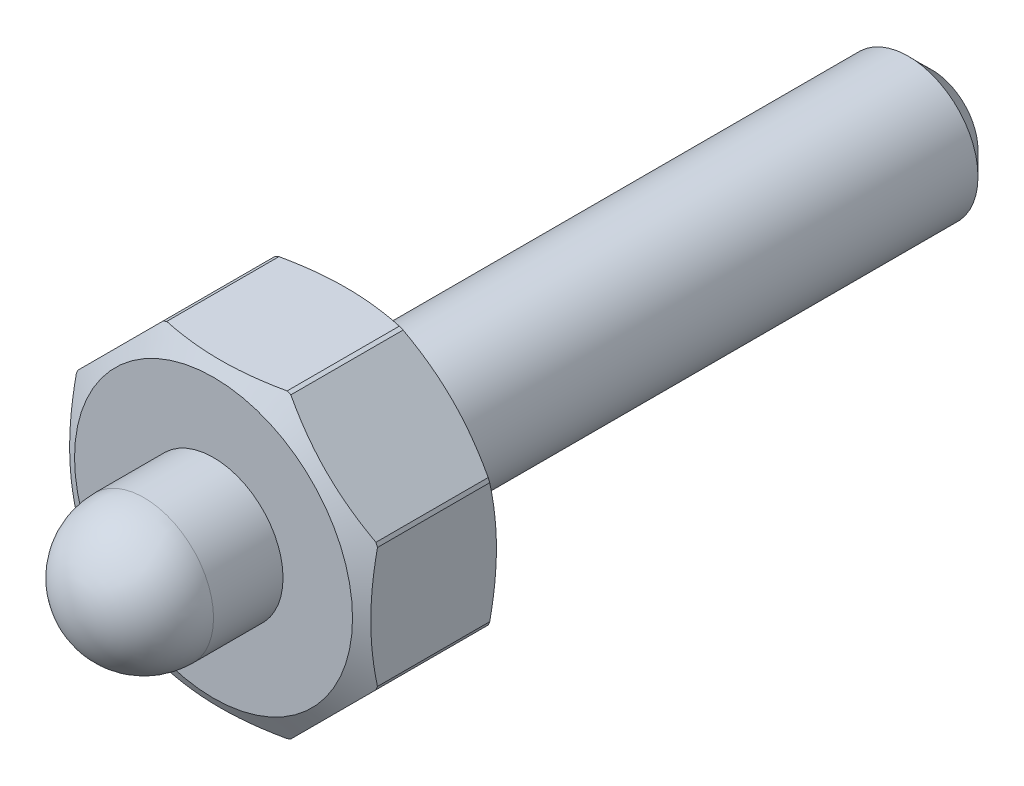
ISO-10303-21;
HEADER;
FILE_DESCRIPTION(('STEP AP214'),'2;1');
FILE_NAME('part.step','',(''),(''),'','','');
FILE_SCHEMA(('AUTOMOTIVE_DESIGN { 1 0 10303 214 1 1 1 1 }'));
ENDSEC;
DATA;
#1=APPLICATION_CONTEXT('core data for automotive mechanical design processes');
#2=APPLICATION_PROTOCOL_DEFINITION('international standard','automotive_design',2000,#1);
#3=PRODUCT_CONTEXT('',#1,'mechanical');
#4=PRODUCT('Part','Part','',(#3));
#5=PRODUCT_RELATED_PRODUCT_CATEGORY('part','',(#4));
#6=PRODUCT_DEFINITION_FORMATION('','',#4);
#7=PRODUCT_DEFINITION_CONTEXT('part definition',#1,'design');
#8=PRODUCT_DEFINITION('design','',#6,#7);
#9=PRODUCT_DEFINITION_SHAPE('','',#8);
#10=(LENGTH_UNIT() NAMED_UNIT(*) SI_UNIT(.MILLI.,.METRE.));
#11=(NAMED_UNIT(*) PLANE_ANGLE_UNIT() SI_UNIT($,.RADIAN.));
#12=(NAMED_UNIT(*) SI_UNIT($,.STERADIAN.) SOLID_ANGLE_UNIT());
#13=UNCERTAINTY_MEASURE_WITH_UNIT(LENGTH_MEASURE(1.E-05),#10,'distance_accuracy_value','');
#14=(GEOMETRIC_REPRESENTATION_CONTEXT(3) GLOBAL_UNCERTAINTY_ASSIGNED_CONTEXT((#13)) GLOBAL_UNIT_ASSIGNED_CONTEXT((#10,
#11,#12)) REPRESENTATION_CONTEXT('',''));
#15=CARTESIAN_POINT('',(0.,0.,0.));
#16=DIRECTION('',(0.,0.,1.));
#17=DIRECTION('',(1.,0.,0.));
#18=AXIS2_PLACEMENT_3D('',#15,#16,#17);
#19=CARTESIAN_POINT('',(0.,0.,100.));
#20=DIRECTION('',(0.,0.,1.));
#21=DIRECTION('',(1.,0.,0.));
#22=AXIS2_PLACEMENT_3D('',#19,#20,#21);
#23=CYLINDRICAL_SURFACE('',#22,7.);
#24=DIRECTION('',(0.,0.,1.));
#25=VECTOR('',#24,1.);
#26=CARTESIAN_POINT('',(-6.43331138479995,2.75907677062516,100.));
#27=LINE('',#26,#25);
#28=CARTESIAN_POINT('',(-6.43331138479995,2.75907677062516,25.5773502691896));
#29=VERTEX_POINT('',#28);
#30=CARTESIAN_POINT('',(-6.43331138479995,2.75907677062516,30.4226497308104));
#31=VERTEX_POINT('',#30);
#32=EDGE_CURVE('E145',#29,#31,#27,.T.);
#33=ORIENTED_EDGE('',*,*,#32,.F.);
#34=CARTESIAN_POINT('',(0.,0.,25.5773502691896));
#35=DIRECTION('',(0.,0.,1.));
#36=DIRECTION('',(1.,0.,0.));
#37=AXIS2_PLACEMENT_3D('',#34,#35,#36);
#38=CIRCLE('',#37,7.);
#39=CARTESIAN_POINT('',(-6.5,2.59807621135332,25.5773502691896));
#40=VERTEX_POINT('',#39);
#41=EDGE_CURVE('E29',#29,#40,#38,.T.);
#42=ORIENTED_EDGE('',*,*,#41,.T.);
#43=DIRECTION('',(0.,0.,1.));
#44=VECTOR('',#43,1.);
#45=CARTESIAN_POINT('',(-6.5,2.59807621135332,100.));
#46=LINE('',#45,#44);
#47=CARTESIAN_POINT('',(-6.5,2.59807621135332,30.4226497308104));
#48=VERTEX_POINT('',#47);
#49=EDGE_CURVE('E146',#40,#48,#46,.T.);
#50=ORIENTED_EDGE('',*,*,#49,.T.);
#51=CARTESIAN_POINT('',(0.,0.,30.4226497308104));
#52=DIRECTION('',(0.,0.,-1.));
#53=DIRECTION('',(-1.,0.,0.));
#54=AXIS2_PLACEMENT_3D('',#51,#52,#53);
#55=CIRCLE('',#54,7.);
#56=EDGE_CURVE('E279',#48,#31,#55,.T.);
#57=ORIENTED_EDGE('',*,*,#56,.T.);
#58=EDGE_LOOP('',(#33,#42,#50,#57));
#59=FACE_BOUND('',#58,.T.);
#60=ADVANCED_FACE('F14',(#59),#23,.T.);
#61=DIRECTION('',(0.,0.,1.));
#62=VECTOR('',#61,1.);
#63=CARTESIAN_POINT('',(-2.59807621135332,6.5,100.));
#64=LINE('',#63,#62);
#65=CARTESIAN_POINT('',(-2.59807621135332,6.5,25.5773502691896));
#66=VERTEX_POINT('',#65);
#67=CARTESIAN_POINT('',(-2.59807621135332,6.5,30.4226497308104));
#68=VERTEX_POINT('',#67);
#69=EDGE_CURVE('E141',#66,#68,#64,.T.);
#70=ORIENTED_EDGE('',*,*,#69,.F.);
#71=CARTESIAN_POINT('',(0.,0.,25.5773502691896));
#72=DIRECTION('',(0.,0.,1.));
#73=DIRECTION('',(1.,0.,0.));
#74=AXIS2_PLACEMENT_3D('',#71,#72,#73);
#75=CIRCLE('',#74,7.);
#76=CARTESIAN_POINT('',(-2.75907677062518,6.43331138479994,25.5773502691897));
#77=VERTEX_POINT('',#76);
#78=EDGE_CURVE('E129',#66,#77,#75,.T.);
#79=ORIENTED_EDGE('',*,*,#78,.T.);
#80=DIRECTION('',(0.,0.,1.));
#81=VECTOR('',#80,1.);
#82=CARTESIAN_POINT('',(-2.75907677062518,6.43331138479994,100.));
#83=LINE('',#82,#81);
#84=CARTESIAN_POINT('',(-2.75907677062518,6.43331138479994,30.4226497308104));
#85=VERTEX_POINT('',#84);
#86=EDGE_CURVE('E140',#85,#77,#83,.F.);
#87=ORIENTED_EDGE('',*,*,#86,.F.);
#88=CARTESIAN_POINT('',(0.,0.,30.4226497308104));
#89=DIRECTION('',(0.,0.,-1.));
#90=DIRECTION('',(-1.,0.,0.));
#91=AXIS2_PLACEMENT_3D('',#88,#89,#90);
#92=CIRCLE('',#91,7.);
#93=EDGE_CURVE('E37',#85,#68,#92,.T.);
#94=ORIENTED_EDGE('',*,*,#93,.T.);
#95=EDGE_LOOP('',(#70,#79,#87,#94));
#96=FACE_BOUND('',#95,.T.);
#97=ADVANCED_FACE('F139',(#96),#23,.T.);
#98=DIRECTION('',(0.,0.,1.));
#99=VECTOR('',#98,1.);
#100=CARTESIAN_POINT('',(-6.5,-2.59807621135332,100.));
#101=LINE('',#100,#99);
#102=CARTESIAN_POINT('',(-6.5,-2.59807621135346,30.4226497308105));
#103=VERTEX_POINT('',#102);
#104=CARTESIAN_POINT('',(-6.5,-2.59807621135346,25.5773502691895));
#105=VERTEX_POINT('',#104);
#106=EDGE_CURVE('E150',#103,#105,#101,.F.);
#107=ORIENTED_EDGE('',*,*,#106,.T.);
#108=CARTESIAN_POINT('',(0.,0.,25.5773502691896));
#109=DIRECTION('',(0.,0.,1.));
#110=DIRECTION('',(1.,0.,0.));
#111=AXIS2_PLACEMENT_3D('',#108,#109,#110);
#112=CIRCLE('',#111,7.);
#113=CARTESIAN_POINT('',(-6.43331138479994,-2.75907677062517,25.5773502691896));
#114=VERTEX_POINT('',#113);
#115=EDGE_CURVE('E362',#105,#114,#112,.T.);
#116=ORIENTED_EDGE('',*,*,#115,.T.);
#117=DIRECTION('',(0.,0.,1.));
#118=VECTOR('',#117,1.);
#119=CARTESIAN_POINT('',(-6.43331138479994,-2.75907677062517,100.));
#120=LINE('',#119,#118);
#121=CARTESIAN_POINT('',(-6.43331138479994,-2.75907677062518,30.4226497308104));
#122=VERTEX_POINT('',#121);
#123=EDGE_CURVE('E359',#114,#122,#120,.T.);
#124=ORIENTED_EDGE('',*,*,#123,.T.);
#125=CARTESIAN_POINT('',(0.,0.,30.4226497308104));
#126=DIRECTION('',(0.,0.,-1.));
#127=DIRECTION('',(-1.,0.,0.));
#128=AXIS2_PLACEMENT_3D('',#125,#126,#127);
#129=CIRCLE('',#128,7.);
#130=EDGE_CURVE('E290',#122,#103,#129,.T.);
#131=ORIENTED_EDGE('',*,*,#130,.T.);
#132=EDGE_LOOP('',(#107,#116,#124,#131));
#133=FACE_BOUND('',#132,.T.);
#134=ADVANCED_FACE('F361',(#133),#23,.T.);
#135=DIRECTION('',(0.,0.,1.));
#136=VECTOR('',#135,1.);
#137=CARTESIAN_POINT('',(2.59807621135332,-6.5,100.));
#138=LINE('',#137,#136);
#139=CARTESIAN_POINT('',(2.59807621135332,-6.5,25.5773502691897));
#140=VERTEX_POINT('',#139);
#141=CARTESIAN_POINT('',(2.59807621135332,-6.5,30.4226497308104));
#142=VERTEX_POINT('',#141);
#143=EDGE_CURVE('E327',#140,#142,#138,.T.);
#144=ORIENTED_EDGE('',*,*,#143,.F.);
#145=CARTESIAN_POINT('',(0.,0.,25.5773502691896));
#146=DIRECTION('',(0.,0.,1.));
#147=DIRECTION('',(1.,0.,0.));
#148=AXIS2_PLACEMENT_3D('',#145,#146,#147);
#149=CIRCLE('',#148,7.);
#150=CARTESIAN_POINT('',(2.75907677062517,-6.43331138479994,25.5773502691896));
#151=VERTEX_POINT('',#150);
#152=EDGE_CURVE('E266',#140,#151,#149,.T.);
#153=ORIENTED_EDGE('',*,*,#152,.T.);
#154=DIRECTION('',(0.,0.,1.));
#155=VECTOR('',#154,1.);
#156=CARTESIAN_POINT('',(2.75907677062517,-6.43331138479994,100.));
#157=LINE('',#156,#155);
#158=CARTESIAN_POINT('',(2.75907677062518,-6.43331138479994,30.4226497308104));
#159=VERTEX_POINT('',#158);
#160=EDGE_CURVE('E329',#151,#159,#157,.T.);
#161=ORIENTED_EDGE('',*,*,#160,.T.);
#162=CARTESIAN_POINT('',(0.,0.,30.4226497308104));
#163=DIRECTION('',(0.,0.,-1.));
#164=DIRECTION('',(-1.,0.,0.));
#165=AXIS2_PLACEMENT_3D('',#162,#163,#164);
#166=CIRCLE('',#165,7.);
#167=EDGE_CURVE('E320',#159,#142,#166,.T.);
#168=ORIENTED_EDGE('',*,*,#167,.T.);
#169=EDGE_LOOP('',(#144,#153,#161,#168));
#170=FACE_BOUND('',#169,.T.);
#171=ADVANCED_FACE('F326',(#170),#23,.T.);
#172=DIRECTION('',(0.,0.,1.));
#173=VECTOR('',#172,1.);
#174=CARTESIAN_POINT('',(-2.75907677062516,-6.43331138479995,100.));
#175=LINE('',#174,#173);
#176=CARTESIAN_POINT('',(-2.75907677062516,-6.43331138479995,30.4226497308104));
#177=VERTEX_POINT('',#176);
#178=CARTESIAN_POINT('',(-2.75907677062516,-6.43331138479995,25.5773502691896));
#179=VERTEX_POINT('',#178);
#180=EDGE_CURVE('E357',#177,#179,#175,.F.);
#181=ORIENTED_EDGE('',*,*,#180,.T.);
#182=CARTESIAN_POINT('',(0.,0.,25.5773502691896));
#183=DIRECTION('',(0.,0.,1.));
#184=DIRECTION('',(1.,0.,0.));
#185=AXIS2_PLACEMENT_3D('',#182,#183,#184);
#186=CIRCLE('',#185,7.);
#187=CARTESIAN_POINT('',(-2.59807621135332,-6.5,25.5773502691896));
#188=VERTEX_POINT('',#187);
#189=EDGE_CURVE('E599',#179,#188,#186,.T.);
#190=ORIENTED_EDGE('',*,*,#189,.T.);
#191=DIRECTION('',(0.,0.,1.));
#192=VECTOR('',#191,1.);
#193=CARTESIAN_POINT('',(-2.59807621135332,-6.5,100.));
#194=LINE('',#193,#192);
#195=CARTESIAN_POINT('',(-2.59807621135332,-6.5,30.4226497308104));
#196=VERTEX_POINT('',#195);
#197=EDGE_CURVE('E354',#196,#188,#194,.F.);
#198=ORIENTED_EDGE('',*,*,#197,.F.);
#199=CARTESIAN_POINT('',(0.,0.,30.4226497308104));
#200=DIRECTION('',(0.,0.,-1.));
#201=DIRECTION('',(-1.,0.,0.));
#202=AXIS2_PLACEMENT_3D('',#199,#200,#201);
#203=CIRCLE('',#202,7.);
#204=EDGE_CURVE('E308',#196,#177,#203,.T.);
#205=ORIENTED_EDGE('',*,*,#204,.T.);
#206=EDGE_LOOP('',(#181,#190,#198,#205));
#207=FACE_BOUND('',#206,.T.);
#208=ADVANCED_FACE('F547',(#207),#23,.T.);
#209=DIRECTION('',(0.,0.,1.));
#210=VECTOR('',#209,1.);
#211=CARTESIAN_POINT('',(6.5,2.59807621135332,100.));
#212=LINE('',#211,#210);
#213=CARTESIAN_POINT('',(6.5,2.59807621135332,25.5773502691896));
#214=VERTEX_POINT('',#213);
#215=CARTESIAN_POINT('',(6.5,2.59807621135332,30.4226497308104));
#216=VERTEX_POINT('',#215);
#217=EDGE_CURVE('E348',#214,#216,#212,.T.);
#218=ORIENTED_EDGE('',*,*,#217,.F.);
#219=CARTESIAN_POINT('',(0.,0.,25.5773502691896));
#220=DIRECTION('',(0.,0.,1.));
#221=DIRECTION('',(1.,0.,0.));
#222=AXIS2_PLACEMENT_3D('',#219,#220,#221);
#223=CIRCLE('',#222,7.);
#224=CARTESIAN_POINT('',(6.43331138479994,2.75907677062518,25.5773502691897));
#225=VERTEX_POINT('',#224);
#226=EDGE_CURVE('E605',#214,#225,#223,.T.);
#227=ORIENTED_EDGE('',*,*,#226,.T.);
#228=DIRECTION('',(0.,0.,1.));
#229=VECTOR('',#228,1.);
#230=CARTESIAN_POINT('',(6.43331138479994,2.75907677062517,100.));
#231=LINE('',#230,#229);
#232=CARTESIAN_POINT('',(6.43331138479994,2.75907677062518,30.4226497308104));
#233=VERTEX_POINT('',#232);
#234=EDGE_CURVE('E343',#225,#233,#231,.T.);
#235=ORIENTED_EDGE('',*,*,#234,.T.);
#236=CARTESIAN_POINT('',(0.,0.,30.4226497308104));
#237=DIRECTION('',(0.,0.,-1.));
#238=DIRECTION('',(-1.,0.,0.));
#239=AXIS2_PLACEMENT_3D('',#236,#237,#238);
#240=CIRCLE('',#239,7.);
#241=EDGE_CURVE('E304',#233,#216,#240,.T.);
#242=ORIENTED_EDGE('',*,*,#241,.T.);
#243=EDGE_LOOP('',(#218,#227,#235,#242));
#244=FACE_BOUND('',#243,.T.);
#245=ADVANCED_FACE('F539',(#244),#23,.T.);
#246=DIRECTION('',(0.,0.,1.));
#247=VECTOR('',#246,1.);
#248=CARTESIAN_POINT('',(6.43331138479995,-2.75907677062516,100.));
#249=LINE('',#248,#247);
#250=CARTESIAN_POINT('',(6.43331138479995,-2.75907677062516,30.4226497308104));
#251=VERTEX_POINT('',#250);
#252=CARTESIAN_POINT('',(6.43331138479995,-2.75907677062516,25.5773502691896));
#253=VERTEX_POINT('',#252);
#254=EDGE_CURVE('E350',#251,#253,#249,.F.);
#255=ORIENTED_EDGE('',*,*,#254,.T.);
#256=CARTESIAN_POINT('',(0.,0.,25.5773502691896));
#257=DIRECTION('',(0.,0.,1.));
#258=DIRECTION('',(1.,0.,0.));
#259=AXIS2_PLACEMENT_3D('',#256,#257,#258);
#260=CIRCLE('',#259,7.);
#261=CARTESIAN_POINT('',(6.5,-2.59807621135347,25.5773502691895));
#262=VERTEX_POINT('',#261);
#263=EDGE_CURVE('E257',#253,#262,#260,.T.);
#264=ORIENTED_EDGE('',*,*,#263,.T.);
#265=DIRECTION('',(0.,0.,1.));
#266=VECTOR('',#265,1.);
#267=CARTESIAN_POINT('',(6.5,-2.59807621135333,100.));
#268=LINE('',#267,#266);
#269=CARTESIAN_POINT('',(6.5,-2.59807621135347,30.4226497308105));
#270=VERTEX_POINT('',#269);
#271=EDGE_CURVE('E345',#270,#262,#268,.F.);
#272=ORIENTED_EDGE('',*,*,#271,.F.);
#273=CARTESIAN_POINT('',(0.,0.,30.4226497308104));
#274=DIRECTION('',(0.,0.,-1.));
#275=DIRECTION('',(-1.,0.,0.));
#276=AXIS2_PLACEMENT_3D('',#273,#274,#275);
#277=CIRCLE('',#276,7.);
#278=EDGE_CURVE('E237',#270,#251,#277,.T.);
#279=ORIENTED_EDGE('',*,*,#278,.T.);
#280=EDGE_LOOP('',(#255,#264,#272,#279));
#281=FACE_BOUND('',#280,.T.);
#282=ADVANCED_FACE('F532',(#281),#23,.T.);
#283=DIRECTION('',(0.,0.,1.));
#284=VECTOR('',#283,1.);
#285=CARTESIAN_POINT('',(2.75907677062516,6.43331138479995,100.));
#286=LINE('',#285,#284);
#287=CARTESIAN_POINT('',(2.75907677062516,6.43331138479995,30.4226497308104));
#288=VERTEX_POINT('',#287);
#289=CARTESIAN_POINT('',(2.75907677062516,6.43331138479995,25.5773502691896));
#290=VERTEX_POINT('',#289);
#291=EDGE_CURVE('E341',#288,#290,#286,.F.);
#292=ORIENTED_EDGE('',*,*,#291,.T.);
#293=CARTESIAN_POINT('',(0.,0.,25.5773502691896));
#294=DIRECTION('',(0.,0.,1.));
#295=DIRECTION('',(1.,0.,0.));
#296=AXIS2_PLACEMENT_3D('',#293,#294,#295);
#297=CIRCLE('',#296,7.);
#298=CARTESIAN_POINT('',(2.59807621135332,6.5,25.5773502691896));
#299=VERTEX_POINT('',#298);
#300=EDGE_CURVE('E368',#290,#299,#297,.T.);
#301=ORIENTED_EDGE('',*,*,#300,.T.);
#302=DIRECTION('',(0.,0.,1.));
#303=VECTOR('',#302,1.);
#304=CARTESIAN_POINT('',(2.59807621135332,6.5,100.));
#305=LINE('',#304,#303);
#306=CARTESIAN_POINT('',(2.59807621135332,6.5,30.4226497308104));
#307=VERTEX_POINT('',#306);
#308=EDGE_CURVE('E331',#307,#299,#305,.F.);
#309=ORIENTED_EDGE('',*,*,#308,.F.);
#310=CARTESIAN_POINT('',(0.,0.,30.4226497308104));
#311=DIRECTION('',(0.,0.,-1.));
#312=DIRECTION('',(-1.,0.,0.));
#313=AXIS2_PLACEMENT_3D('',#310,#311,#312);
#314=CIRCLE('',#313,7.);
#315=EDGE_CURVE('E287',#307,#288,#314,.T.);
#316=ORIENTED_EDGE('',*,*,#315,.T.);
#317=EDGE_LOOP('',(#292,#301,#309,#316));
#318=FACE_BOUND('',#317,.T.);
#319=ADVANCED_FACE('F399',(#318),#23,.T.);
#320=CARTESIAN_POINT('',(-2.69238815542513,6.5,31.));
#321=DIRECTION('',(0.,1.,0.));
#322=DIRECTION('',(0.,0.,1.));
#323=AXIS2_PLACEMENT_3D('',#320,#321,#322);
#324=PLANE('',#323);
#325=CARTESIAN_POINT('',(-8.07795557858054,6.5,27.522087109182));
#326=CARTESIAN_POINT('',(-7.83219090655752,6.5,27.4115757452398));
#327=CARTESIAN_POINT('',(-7.58569712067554,6.5,27.3026492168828));
#328=CARTESIAN_POINT('',(-7.09091453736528,6.5,27.088790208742));
#329=CARTESIAN_POINT('',(-6.84262531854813,6.5,26.9838587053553));
#330=CARTESIAN_POINT('',(-6.34255579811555,6.5,26.7782608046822));
#331=CARTESIAN_POINT('',(-6.09076352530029,6.5,26.6776233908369));
#332=CARTESIAN_POINT('',(-5.58483527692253,6.5,26.4824439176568));
#333=CARTESIAN_POINT('',(-5.33069945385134,6.5,26.3879014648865));
#334=CARTESIAN_POINT('',(-4.82246657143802,6.5,26.2073186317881));
#335=CARTESIAN_POINT('',(-4.56839814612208,6.5,26.1211981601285));
#336=CARTESIAN_POINT('',(-4.05731271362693,6.5,25.9580564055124));
#337=CARTESIAN_POINT('',(-3.80029548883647,6.5,25.8810357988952));
#338=CARTESIAN_POINT('',(-3.28370931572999,6.5,25.7383361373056));
#339=CARTESIAN_POINT('',(-3.02414726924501,6.5,25.6726323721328));
#340=CARTESIAN_POINT('',(-2.50201257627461,6.5,25.5547032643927));
#341=CARTESIAN_POINT('',(-2.23944067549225,6.5,25.5024746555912));
#342=CARTESIAN_POINT('',(-1.67156159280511,6.5,25.4071474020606));
#343=CARTESIAN_POINT('',(-1.36580884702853,6.5,25.3666322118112));
#344=CARTESIAN_POINT('',(-0.751989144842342,6.5,25.3096603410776));
#345=CARTESIAN_POINT('',(-0.443921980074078,6.5,25.2932058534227));
#346=CARTESIAN_POINT('',(0.17283147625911,6.5,25.2857761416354));
#347=CARTESIAN_POINT('',(0.481518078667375,6.5,25.2948258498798));
#348=CARTESIAN_POINT('',(1.09704442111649,6.5,25.3376556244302));
#349=CARTESIAN_POINT('',(1.403884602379,6.5,25.3714295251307));
#350=CARTESIAN_POINT('',(2.0308112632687,6.5,25.4634608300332));
#351=CARTESIAN_POINT('',(2.35071365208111,6.5,25.5229467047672));
#352=CARTESIAN_POINT('',(2.98612509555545,6.5,25.6622514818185));
#353=CARTESIAN_POINT('',(3.30163196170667,6.5,25.7420801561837));
#354=CARTESIAN_POINT('',(3.92926966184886,6.5,25.91819604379));
#355=CARTESIAN_POINT('',(4.24138267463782,6.5,26.0145458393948));
#356=CARTESIAN_POINT('',(4.86134002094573,6.5,26.2198480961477));
#357=CARTESIAN_POINT('',(5.16918494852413,6.5,26.3287987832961));
#358=CARTESIAN_POINT('',(5.78486325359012,6.5,26.5578025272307));
#359=CARTESIAN_POINT('',(6.09265288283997,6.5,26.6779722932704));
#360=CARTESIAN_POINT('',(6.7051117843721,6.5,26.926041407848));
#361=CARTESIAN_POINT('',(7.00978079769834,6.5,27.053941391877));
#362=CARTESIAN_POINT('',(7.61355915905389,6.5,27.3144930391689));
#363=CARTESIAN_POINT('',(7.91269376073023,6.5,27.4470863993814));
#364=CARTESIAN_POINT('',(8.35975698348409,6.5,27.6494629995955));
#365=CARTESIAN_POINT('',(8.50848359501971,6.5,27.7174928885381));
#366=CARTESIAN_POINT('',(8.80544949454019,6.5,27.8546009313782));
#367=CARTESIAN_POINT('',(8.95368879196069,6.5,27.923679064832));
#368=CARTESIAN_POINT('',(9.1017094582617,6.5,27.9932227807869));
#369=B_SPLINE_CURVE_WITH_KNOTS('',3,(#325,#326,#327,#328,#329,#330,#331,#332,#333,#334,#335,
#336,#337,#338,#339,#340,#341,#342,#343,#344,#345,#346,#347,#348,#349,#350,#351,#352,#353,#354,
#355,#356,#357,#358,#359,#360,#361,#362,#363,#364,#365,#366,#367,#368),.UNSPECIFIED.,.F.,.F.,(4,
2,2,2,2,2,2,2,2,2,2,2,2,2,2,2,2,2,2,2,2,4),(0.,0.808421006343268,1.61703834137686,
2.43045099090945,3.24381108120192,4.04847533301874,4.85319935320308,5.6561433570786,
6.45889255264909,7.38330652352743,8.30780473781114,9.23320703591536,10.1583786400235,
11.13372476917,12.109540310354,13.0891373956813,14.0685967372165,15.0597138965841,
16.0509126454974,17.0324724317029,17.5231107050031,18.0137394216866),.UNSPECIFIED.);
#370=EDGE_CURVE('E366',#66,#299,#369,.T.);
#371=ORIENTED_EDGE('',*,*,#370,.F.);
#372=ORIENTED_EDGE('',*,*,#69,.T.);
#373=CARTESIAN_POINT('',(-8.08694321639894,6.5,28.4738692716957));
#374=CARTESIAN_POINT('',(-7.84098109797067,6.5,28.5845177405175));
#375=CARTESIAN_POINT('',(-7.59429001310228,6.5,28.6935823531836));
#376=CARTESIAN_POINT('',(-7.09911283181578,6.5,28.907719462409));
#377=CARTESIAN_POINT('',(-6.85062631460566,6.5,29.0127909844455));
#378=CARTESIAN_POINT('',(-6.35016010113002,6.5,29.2186719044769));
#379=CARTESIAN_POINT('',(-6.09816842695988,6.5,29.3194523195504));
#380=CARTESIAN_POINT('',(-5.59184037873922,6.5,29.514919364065));
#381=CARTESIAN_POINT('',(-5.33750415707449,6.5,29.609606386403));
#382=CARTESIAN_POINT('',(-4.82885072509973,6.5,29.7904846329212));
#383=CARTESIAN_POINT('',(-4.57456196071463,6.5,29.8767553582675));
#384=CARTESIAN_POINT('',(-4.06303214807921,6.5,30.0401950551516));
#385=CARTESIAN_POINT('',(-3.80579088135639,6.5,30.1173633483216));
#386=CARTESIAN_POINT('',(-3.28875205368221,6.5,30.2603518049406));
#387=CARTESIAN_POINT('',(-3.02896140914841,6.5,30.326196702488));
#388=CARTESIAN_POINT('',(-2.50636264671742,6.5,30.4443963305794));
#389=CARTESIAN_POINT('',(-2.24355527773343,6.5,30.496754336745));
#390=CARTESIAN_POINT('',(-1.67539652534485,6.5,30.5922998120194));
#391=CARTESIAN_POINT('',(-1.36960107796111,6.5,30.6329169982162));
#392=CARTESIAN_POINT('',(-0.755688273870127,6.5,30.6900938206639));
#393=CARTESIAN_POINT('',(-0.447570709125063,6.5,30.7066512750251));
#394=CARTESIAN_POINT('',(0.169282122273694,6.5,30.7142789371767));
#395=CARTESIAN_POINT('',(0.478017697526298,6.5,30.7053250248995));
#396=CARTESIAN_POINT('',(1.09364848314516,6.5,30.6626724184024));
#397=CARTESIAN_POINT('',(1.40054413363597,6.5,30.6289799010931));
#398=CARTESIAN_POINT('',(2.02716707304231,6.5,30.537158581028));
#399=CARTESIAN_POINT('',(2.34671522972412,6.5,30.4778323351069));
#400=CARTESIAN_POINT('',(2.9814302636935,6.5,30.3388742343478));
#401=CARTESIAN_POINT('',(3.29659496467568,6.5,30.2592326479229));
#402=CARTESIAN_POINT('',(3.92355520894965,6.5,30.083506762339));
#403=CARTESIAN_POINT('',(4.23533298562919,6.5,29.9873600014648));
#404=CARTESIAN_POINT('',(4.85462640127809,6.5,29.7824707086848));
#405=CARTESIAN_POINT('',(5.16214263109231,6.5,29.6737299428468));
#406=CARTESIAN_POINT('',(5.7771944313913,6.5,29.4451395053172));
#407=CARTESIAN_POINT('',(6.08468592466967,6.5,29.3251721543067));
#408=CARTESIAN_POINT('',(6.69655008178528,6.5,29.077506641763));
#409=CARTESIAN_POINT('',(7.00092248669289,6.5,28.9498078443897));
#410=CARTESIAN_POINT('',(7.60411354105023,6.5,28.6896536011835));
#411=CARTESIAN_POINT('',(7.90295741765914,6.5,28.5572564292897));
#412=CARTESIAN_POINT('',(8.34958453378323,6.5,28.3551724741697));
#413=CARTESIAN_POINT('',(8.49816576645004,6.5,28.2872398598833));
#414=CARTESIAN_POINT('',(8.79484086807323,6.5,28.1503258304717));
#415=CARTESIAN_POINT('',(8.94293474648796,6.5,28.0813444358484));
#416=CARTESIAN_POINT('',(9.0908099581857,6.5,28.0118971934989));
#417=B_SPLINE_CURVE_WITH_KNOTS('',3,(#373,#374,#375,#376,#377,#378,#379,#380,#381,#382,#383,
#384,#385,#386,#387,#388,#389,#390,#391,#392,#393,#394,#395,#396,#397,#398,#399,#400,#401,#402,
#403,#404,#405,#406,#407,#408,#409,#410,#411,#412,#413,#414,#415,#416),.UNSPECIFIED.,.F.,.F.,(4,
2,2,2,2,2,2,2,2,2,2,2,2,2,2,2,2,2,2,2,2,4),(0.,0.80912992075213,1.61845605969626,
2.43258351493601,3.24665842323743,4.05209350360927,4.85758857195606,5.66130118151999,
6.46481840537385,7.38940013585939,8.31406570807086,9.23960580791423,10.1649148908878,
11.1391306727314,12.1138140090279,13.0922706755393,14.07059029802,15.0606533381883,
16.0507979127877,17.031321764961,17.5214420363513,18.0115527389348),.UNSPECIFIED.);
#418=EDGE_CURVE('E196',#307,#68,#417,.F.);
#419=ORIENTED_EDGE('',*,*,#418,.F.);
#420=ORIENTED_EDGE('',*,*,#308,.T.);
#421=EDGE_LOOP('',(#371,#372,#419,#420));
#422=FACE_BOUND('',#421,.T.);
#423=ADVANCED_FACE('F518',(#422),#324,.T.);
#424=CARTESIAN_POINT('',(6.5,2.69238815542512,31.));
#425=DIRECTION('',(-0.707106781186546,-0.707106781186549,0.));
#426=DIRECTION('',(0.707106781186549,-0.707106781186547,0.));
#427=AXIS2_PLACEMENT_3D('',#424,#425,#426);
#428=PLANE('',#427);
#429=ORIENTED_EDGE('',*,*,#234,.F.);
#430=CARTESIAN_POINT('',(6.43351138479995,2.75887677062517,25.5774108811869));
#431=CARTESIAN_POINT('',(6.3228472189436,2.86954093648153,25.5438634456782));
#432=CARTESIAN_POINT('',(6.21179034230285,2.98059781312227,25.5128246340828));
#433=CARTESIAN_POINT('',(5.9889514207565,3.20343673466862,25.4562371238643));
#434=CARTESIAN_POINT('',(5.87716919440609,3.31521896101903,25.4306898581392));
#435=CARTESIAN_POINT('',(5.65292442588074,3.53946372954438,25.3855615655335));
#436=CARTESIAN_POINT('',(5.54046148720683,3.65192666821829,25.3659844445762));
#437=CARTESIAN_POINT('',(5.31507887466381,3.8773092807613,25.3332223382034));
#438=CARTESIAN_POINT('',(5.20215924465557,3.99022891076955,25.3200367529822));
#439=CARTESIAN_POINT('',(4.97793785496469,4.21445030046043,25.3005155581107));
#440=CARTESIAN_POINT('',(4.86664099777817,4.32574715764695,25.2940679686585));
#441=CARTESIAN_POINT('',(4.64395421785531,4.54843393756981,25.2877778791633));
#442=CARTESIAN_POINT('',(4.53256429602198,4.65982385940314,25.2879353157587));
#443=CARTESIAN_POINT('',(4.30995522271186,4.88243293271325,25.2948493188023));
#444=CARTESIAN_POINT('',(4.19873600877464,4.99365214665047,25.3016019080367));
#445=CARTESIAN_POINT('',(3.97659729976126,5.21579085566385,25.3215479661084));
#446=CARTESIAN_POINT('',(3.86567777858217,5.32671037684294,25.3347408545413));
#447=CARTESIAN_POINT('',(3.67159127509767,5.52079688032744,25.3632695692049));
#448=CARTESIAN_POINT('',(3.58832467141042,5.60406348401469,25.377274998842));
#449=CARTESIAN_POINT('',(3.42211294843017,5.77027520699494,25.4086174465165));
#450=CARTESIAN_POINT('',(3.33916780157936,5.85322035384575,25.4259541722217));
#451=CARTESIAN_POINT('',(3.17309411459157,6.01929404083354,25.4639018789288));
#452=CARTESIAN_POINT('',(3.08996796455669,6.10242019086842,25.484533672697));
#453=CARTESIAN_POINT('',(2.92411527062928,6.26827288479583,25.5287836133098));
#454=CARTESIAN_POINT('',(2.84138871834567,6.35099943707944,25.5524016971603));
#455=CARTESIAN_POINT('',(2.75887677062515,6.43351138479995,25.5774108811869));
#456=B_SPLINE_CURVE_WITH_KNOTS('',3,(#430,#431,#432,#433,#434,#435,#436,#437,#438,#439,#440,
#441,#442,#443,#444,#445,#446,#447,#448,#449,#450,#451,#452,#453,#454,#455),.UNSPECIFIED.,.F.,
.F.,(4,2,2,2,2,2,2,2,2,2,2,2,4),(0.,0.480178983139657,0.96048310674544,1.44110079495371,
1.92167337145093,2.39412568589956,2.86657346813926,3.33873651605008,3.81085702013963,
4.16657073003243,4.52225323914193,4.88027833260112,5.23829587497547),.UNSPECIFIED.);
#457=EDGE_CURVE('E602',#225,#290,#456,.T.);
#458=ORIENTED_EDGE('',*,*,#457,.T.);
#459=ORIENTED_EDGE('',*,*,#291,.F.);
#460=CARTESIAN_POINT('',(2.75887677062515,6.43351138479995,30.4225891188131));
#461=CARTESIAN_POINT('',(2.86954093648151,6.3228472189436,30.4561365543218));
#462=CARTESIAN_POINT('',(2.98059781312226,6.21179034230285,30.4871753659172));
#463=CARTESIAN_POINT('',(3.20343673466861,5.9889514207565,30.5437628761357));
#464=CARTESIAN_POINT('',(3.31521896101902,5.87716919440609,30.5693101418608));
#465=CARTESIAN_POINT('',(3.53946372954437,5.65292442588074,30.6144384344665));
#466=CARTESIAN_POINT('',(3.65192666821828,5.54046148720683,30.6340155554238));
#467=CARTESIAN_POINT('',(3.87730928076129,5.31507887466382,30.6667776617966));
#468=CARTESIAN_POINT('',(3.99022891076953,5.20215924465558,30.6799632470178));
#469=CARTESIAN_POINT('',(4.21445030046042,4.9779378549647,30.6994844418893));
#470=CARTESIAN_POINT('',(4.32574715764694,4.86664099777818,30.7059320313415));
#471=CARTESIAN_POINT('',(4.5484339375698,4.64395421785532,30.7122221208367));
#472=CARTESIAN_POINT('',(4.65982385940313,4.53256429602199,30.7120646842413));
#473=CARTESIAN_POINT('',(4.88243293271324,4.30995522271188,30.7051506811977));
#474=CARTESIAN_POINT('',(4.99365214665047,4.19873600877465,30.6983980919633));
#475=CARTESIAN_POINT('',(5.21579085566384,3.97659729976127,30.6784520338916));
#476=CARTESIAN_POINT('',(5.32671037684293,3.86567777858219,30.6652591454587));
#477=CARTESIAN_POINT('',(5.52079688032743,3.67159127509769,30.6367304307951));
#478=CARTESIAN_POINT('',(5.60406348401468,3.58832467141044,30.6227250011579));
#479=CARTESIAN_POINT('',(5.77027520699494,3.42211294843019,30.5913825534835));
#480=CARTESIAN_POINT('',(5.85322035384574,3.33916780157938,30.5740458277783));
#481=CARTESIAN_POINT('',(6.01929404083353,3.17309411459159,30.5360981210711));
#482=CARTESIAN_POINT('',(6.10242019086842,3.08996796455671,30.515466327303));
#483=CARTESIAN_POINT('',(6.26827288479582,2.9241152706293,30.4712163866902));
#484=CARTESIAN_POINT('',(6.35099943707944,2.84138871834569,30.4475983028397));
#485=CARTESIAN_POINT('',(6.43351138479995,2.75887677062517,30.4225891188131));
#486=B_SPLINE_CURVE_WITH_KNOTS('',3,(#460,#461,#462,#463,#464,#465,#466,#467,#468,#469,#470,
#471,#472,#473,#474,#475,#476,#477,#478,#479,#480,#481,#482,#483,#484,#485),.UNSPECIFIED.,.F.,
.F.,(4,2,2,2,2,2,2,2,2,2,2,2,4),(0.,0.48017898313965,0.960483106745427,1.44110079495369,
1.92167337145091,2.39412568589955,2.86657346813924,3.33873651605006,3.81085702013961,
4.16657073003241,4.52225323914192,4.8802783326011,5.23829587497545),.UNSPECIFIED.);
#487=EDGE_CURVE('E213',#288,#233,#486,.T.);
#488=ORIENTED_EDGE('',*,*,#487,.T.);
#489=EDGE_LOOP('',(#429,#458,#459,#488));
#490=FACE_BOUND('',#489,.T.);
#491=ADVANCED_FACE('F244',(#490),#428,.F.);
#492=CARTESIAN_POINT('',(6.5,2.69238815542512,31.));
#493=DIRECTION('',(1.,0.,0.));
#494=DIRECTION('',(0.,1.,0.));
#495=AXIS2_PLACEMENT_3D('',#492,#493,#494);
#496=PLANE('',#495);
#497=CARTESIAN_POINT('',(6.5,-8.07795557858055,27.522087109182));
#498=CARTESIAN_POINT('',(6.5,-7.83219090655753,27.4115757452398));
#499=CARTESIAN_POINT('',(6.5,-7.58569712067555,27.3026492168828));
#500=CARTESIAN_POINT('',(6.5,-7.09091453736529,27.088790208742));
#501=CARTESIAN_POINT('',(6.5,-6.84262531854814,26.9838587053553));
#502=CARTESIAN_POINT('',(6.5,-6.34255579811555,26.7782608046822));
#503=CARTESIAN_POINT('',(6.5,-6.0907635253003,26.6776233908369));
#504=CARTESIAN_POINT('',(6.5,-5.58483527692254,26.4824439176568));
#505=CARTESIAN_POINT('',(6.5,-5.33069945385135,26.3879014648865));
#506=CARTESIAN_POINT('',(6.5,-4.82246657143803,26.2073186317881));
#507=CARTESIAN_POINT('',(6.5,-4.56839814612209,26.1211981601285));
#508=CARTESIAN_POINT('',(6.5,-4.05731271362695,25.9580564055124));
#509=CARTESIAN_POINT('',(6.5,-3.80029548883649,25.8810357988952));
#510=CARTESIAN_POINT('',(6.5,-3.28370931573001,25.7383361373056));
#511=CARTESIAN_POINT('',(6.5,-3.02414726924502,25.6726323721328));
#512=CARTESIAN_POINT('',(6.5,-2.50201257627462,25.5547032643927));
#513=CARTESIAN_POINT('',(6.5,-2.23944067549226,25.5024746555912));
#514=CARTESIAN_POINT('',(6.5,-1.67156159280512,25.4071474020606));
#515=CARTESIAN_POINT('',(6.5,-1.36580884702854,25.3666322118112));
#516=CARTESIAN_POINT('',(6.5,-0.751989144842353,25.3096603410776));
#517=CARTESIAN_POINT('',(6.5,-0.443921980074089,25.2932058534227));
#518=CARTESIAN_POINT('',(6.5,0.1728314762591,25.2857761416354));
#519=CARTESIAN_POINT('',(6.5,0.481518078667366,25.2948258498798));
#520=CARTESIAN_POINT('',(6.5,1.09704442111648,25.3376556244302));
#521=CARTESIAN_POINT('',(6.5,1.403884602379,25.3714295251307));
#522=CARTESIAN_POINT('',(6.5,2.03081126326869,25.4634608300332));
#523=CARTESIAN_POINT('',(6.5,2.3507136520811,25.5229467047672));
#524=CARTESIAN_POINT('',(6.5,2.98612509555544,25.6622514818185));
#525=CARTESIAN_POINT('',(6.5,3.30163196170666,25.7420801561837));
#526=CARTESIAN_POINT('',(6.5,3.92926966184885,25.91819604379));
#527=CARTESIAN_POINT('',(6.5,4.24138267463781,26.0145458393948));
#528=CARTESIAN_POINT('',(6.5,4.86134002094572,26.2198480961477));
#529=CARTESIAN_POINT('',(6.5,5.16918494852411,26.3287987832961));
#530=CARTESIAN_POINT('',(6.5,5.78486325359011,26.5578025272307));
#531=CARTESIAN_POINT('',(6.5,6.09265288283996,26.6779722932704));
#532=CARTESIAN_POINT('',(6.5,6.70511178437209,26.926041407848));
#533=CARTESIAN_POINT('',(6.5,7.00978079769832,27.053941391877));
#534=CARTESIAN_POINT('',(6.5,7.61355915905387,27.3144930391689));
#535=CARTESIAN_POINT('',(6.5,7.91269376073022,27.4470863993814));
#536=CARTESIAN_POINT('',(6.5,8.35975698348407,27.6494629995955));
#537=CARTESIAN_POINT('',(6.5,8.50848359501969,27.7174928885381));
#538=CARTESIAN_POINT('',(6.5,8.80544949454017,27.8546009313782));
#539=CARTESIAN_POINT('',(6.5,8.95368879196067,27.923679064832));
#540=CARTESIAN_POINT('',(6.5,9.10170945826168,27.9932227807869));
#541=B_SPLINE_CURVE_WITH_KNOTS('',3,(#497,#498,#499,#500,#501,#502,#503,#504,#505,#506,#507,
#508,#509,#510,#511,#512,#513,#514,#515,#516,#517,#518,#519,#520,#521,#522,#523,#524,#525,#526,
#527,#528,#529,#530,#531,#532,#533,#534,#535,#536,#537,#538,#539,#540),.UNSPECIFIED.,.F.,.F.,(4,
2,2,2,2,2,2,2,2,2,2,2,2,2,2,2,2,2,2,2,2,4),(0.,0.808421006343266,1.61703834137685,
2.43045099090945,3.24381108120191,4.04847533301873,4.85319935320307,5.65614335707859,
6.45889255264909,7.38330652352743,8.30780473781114,9.23320703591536,10.1583786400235,
11.13372476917,12.109540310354,13.0891373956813,14.0685967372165,15.0597138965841,
16.0509126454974,17.0324724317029,17.5231107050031,18.0137394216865),.UNSPECIFIED.);
#542=EDGE_CURVE('E250',#214,#262,#541,.F.);
#543=ORIENTED_EDGE('',*,*,#542,.F.);
#544=ORIENTED_EDGE('',*,*,#217,.T.);
#545=CARTESIAN_POINT('',(6.5,-8.08694321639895,28.4738692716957));
#546=CARTESIAN_POINT('',(6.5,-7.84098109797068,28.5845177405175));
#547=CARTESIAN_POINT('',(6.5,-7.59429001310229,28.6935823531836));
#548=CARTESIAN_POINT('',(6.5,-7.09911283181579,28.9077194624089));
#549=CARTESIAN_POINT('',(6.5,-6.85062631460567,29.0127909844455));
#550=CARTESIAN_POINT('',(6.5,-6.35016010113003,29.2186719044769));
#551=CARTESIAN_POINT('',(6.5,-6.09816842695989,29.3194523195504));
#552=CARTESIAN_POINT('',(6.5,-5.59184037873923,29.514919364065));
#553=CARTESIAN_POINT('',(6.5,-5.3375041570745,29.609606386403));
#554=CARTESIAN_POINT('',(6.5,-4.82885072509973,29.7904846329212));
#555=CARTESIAN_POINT('',(6.5,-4.57456196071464,29.8767553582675));
#556=CARTESIAN_POINT('',(6.5,-4.06303214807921,30.0401950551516));
#557=CARTESIAN_POINT('',(6.5,-3.8057908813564,30.1173633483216));
#558=CARTESIAN_POINT('',(6.5,-3.28875205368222,30.2603518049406));
#559=CARTESIAN_POINT('',(6.5,-3.02896140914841,30.326196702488));
#560=CARTESIAN_POINT('',(6.5,-2.50636264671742,30.4443963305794));
#561=CARTESIAN_POINT('',(6.5,-2.24355527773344,30.496754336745));
#562=CARTESIAN_POINT('',(6.5,-1.67539652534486,30.5922998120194));
#563=CARTESIAN_POINT('',(6.5,-1.36960107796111,30.6329169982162));
#564=CARTESIAN_POINT('',(6.5,-0.755688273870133,30.6900938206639));
#565=CARTESIAN_POINT('',(6.5,-0.447570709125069,30.7066512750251));
#566=CARTESIAN_POINT('',(6.5,0.16928212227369,30.7142789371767));
#567=CARTESIAN_POINT('',(6.5,0.478017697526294,30.7053250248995));
#568=CARTESIAN_POINT('',(6.5,1.09364848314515,30.6626724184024));
#569=CARTESIAN_POINT('',(6.5,1.40054413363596,30.6289799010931));
#570=CARTESIAN_POINT('',(6.5,2.0271670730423,30.537158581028));
#571=CARTESIAN_POINT('',(6.5,2.34671522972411,30.4778323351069));
#572=CARTESIAN_POINT('',(6.5,2.98143026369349,30.3388742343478));
#573=CARTESIAN_POINT('',(6.5,3.29659496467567,30.2592326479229));
#574=CARTESIAN_POINT('',(6.5,3.92355520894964,30.083506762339));
#575=CARTESIAN_POINT('',(6.5,4.23533298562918,29.9873600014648));
#576=CARTESIAN_POINT('',(6.5,4.85462640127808,29.7824707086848));
#577=CARTESIAN_POINT('',(6.5,5.1621426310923,29.6737299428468));
#578=CARTESIAN_POINT('',(6.5,5.77719443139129,29.4451395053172));
#579=CARTESIAN_POINT('',(6.5,6.08468592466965,29.3251721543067));
#580=CARTESIAN_POINT('',(6.5,6.69655008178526,29.077506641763));
#581=CARTESIAN_POINT('',(6.5,7.00092248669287,28.9498078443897));
#582=CARTESIAN_POINT('',(6.5,7.60411354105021,28.6896536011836));
#583=CARTESIAN_POINT('',(6.5,7.90295741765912,28.5572564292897));
#584=CARTESIAN_POINT('',(6.5,8.34958453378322,28.3551724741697));
#585=CARTESIAN_POINT('',(6.5,8.49816576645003,28.2872398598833));
#586=CARTESIAN_POINT('',(6.5,8.79484086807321,28.1503258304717));
#587=CARTESIAN_POINT('',(6.5,8.94293474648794,28.0813444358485));
#588=CARTESIAN_POINT('',(6.5,9.09080995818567,28.0118971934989));
#589=B_SPLINE_CURVE_WITH_KNOTS('',3,(#545,#546,#547,#548,#549,#550,#551,#552,#553,#554,#555,
#556,#557,#558,#559,#560,#561,#562,#563,#564,#565,#566,#567,#568,#569,#570,#571,#572,#573,#574,
#575,#576,#577,#578,#579,#580,#581,#582,#583,#584,#585,#586,#587,#588),.UNSPECIFIED.,.F.,.F.,(4,
2,2,2,2,2,2,2,2,2,2,2,2,2,2,2,2,2,2,2,2,4),(0.,0.809129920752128,1.61845605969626,
2.43258351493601,3.24665842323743,4.05209350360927,4.85758857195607,5.66130118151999,
6.46481840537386,7.38940013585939,8.31406570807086,9.23960580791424,10.1649148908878,
11.1391306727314,12.1138140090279,13.0922706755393,14.07059029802,15.0606533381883,
16.0507979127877,17.031321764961,17.5214420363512,18.0115527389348),.UNSPECIFIED.);
#590=EDGE_CURVE('E229',#270,#216,#589,.T.);
#591=ORIENTED_EDGE('',*,*,#590,.F.);
#592=ORIENTED_EDGE('',*,*,#271,.T.);
#593=EDGE_LOOP('',(#543,#544,#591,#592));
#594=FACE_BOUND('',#593,.T.);
#595=ADVANCED_FACE('F239',(#594),#496,.T.);
#596=CARTESIAN_POINT('',(2.69238815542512,-6.5,31.));
#597=DIRECTION('',(-0.707106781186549,0.707106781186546,0.));
#598=DIRECTION('',(-0.707106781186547,-0.707106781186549,0.));
#599=AXIS2_PLACEMENT_3D('',#596,#597,#598);
#600=PLANE('',#599);
#601=ORIENTED_EDGE('',*,*,#160,.F.);
#602=CARTESIAN_POINT('',(2.75887677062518,-6.43351138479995,25.5774108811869));
#603=CARTESIAN_POINT('',(2.86954093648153,-6.3228472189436,25.5438634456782));
#604=CARTESIAN_POINT('',(2.98059781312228,-6.21179034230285,25.5128246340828));
#605=CARTESIAN_POINT('',(3.20343673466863,-5.98895142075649,25.4562371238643));
#606=CARTESIAN_POINT('',(3.31521896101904,-5.87716919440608,25.4306898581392));
#607=CARTESIAN_POINT('',(3.53946372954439,-5.65292442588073,25.3855615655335));
#608=CARTESIAN_POINT('',(3.6519266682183,-5.54046148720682,25.3659844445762));
#609=CARTESIAN_POINT('',(3.87730928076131,-5.31507887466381,25.3332223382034));
#610=CARTESIAN_POINT('',(3.99022891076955,-5.20215924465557,25.3200367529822));
#611=CARTESIAN_POINT('',(4.21445030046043,-4.97793785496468,25.3005155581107));
#612=CARTESIAN_POINT('',(4.32574715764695,-4.86664099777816,25.2940679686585));
#613=CARTESIAN_POINT('',(4.54843393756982,-4.6439542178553,25.2877778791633));
#614=CARTESIAN_POINT('',(4.65982385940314,-4.53256429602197,25.2879353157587));
#615=CARTESIAN_POINT('',(4.88243293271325,-4.30995522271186,25.2948493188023));
#616=CARTESIAN_POINT('',(4.99365214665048,-4.19873600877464,25.3016019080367));
#617=CARTESIAN_POINT('',(5.21579085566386,-3.97659729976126,25.3215479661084));
#618=CARTESIAN_POINT('',(5.32671037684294,-3.86567777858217,25.3347408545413));
#619=CARTESIAN_POINT('',(5.52079688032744,-3.67159127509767,25.3632695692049));
#620=CARTESIAN_POINT('',(5.60406348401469,-3.58832467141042,25.377274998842));
#621=CARTESIAN_POINT('',(5.77027520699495,-3.42211294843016,25.4086174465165));
#622=CARTESIAN_POINT('',(5.85322035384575,-3.33916780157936,25.4259541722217));
#623=CARTESIAN_POINT('',(6.01929404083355,-3.17309411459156,25.4639018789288));
#624=CARTESIAN_POINT('',(6.10242019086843,-3.08996796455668,25.484533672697));
#625=CARTESIAN_POINT('',(6.26827288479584,-2.92411527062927,25.5287836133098));
#626=CARTESIAN_POINT('',(6.35099943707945,-2.84138871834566,25.5524016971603));
#627=CARTESIAN_POINT('',(6.43351138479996,-2.75887677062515,25.5774108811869));
#628=B_SPLINE_CURVE_WITH_KNOTS('',3,(#602,#603,#604,#605,#606,#607,#608,#609,#610,#611,#612,
#613,#614,#615,#616,#617,#618,#619,#620,#621,#622,#623,#624,#625,#626,#627),.UNSPECIFIED.,.F.,
.F.,(4,2,2,2,2,2,2,2,2,2,2,2,4),(0.,0.480178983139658,0.960483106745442,1.44110079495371,
1.92167337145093,2.39412568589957,2.86657346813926,3.33873651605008,3.81085702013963,
4.16657073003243,4.52225323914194,4.88027833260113,5.23829587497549),.UNSPECIFIED.);
#629=EDGE_CURVE('E269',#151,#253,#628,.T.);
#630=ORIENTED_EDGE('',*,*,#629,.T.);
#631=ORIENTED_EDGE('',*,*,#254,.F.);
#632=CARTESIAN_POINT('',(6.43351138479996,-2.75887677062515,30.4225891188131));
#633=CARTESIAN_POINT('',(6.3228472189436,-2.86954093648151,30.4561365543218));
#634=CARTESIAN_POINT('',(6.21179034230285,-2.98059781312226,30.4871753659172));
#635=CARTESIAN_POINT('',(5.9889514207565,-3.20343673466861,30.5437628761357));
#636=CARTESIAN_POINT('',(5.8771691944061,-3.31521896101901,30.5693101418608));
#637=CARTESIAN_POINT('',(5.65292442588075,-3.53946372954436,30.6144384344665));
#638=CARTESIAN_POINT('',(5.54046148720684,-3.65192666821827,30.6340155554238));
#639=CARTESIAN_POINT('',(5.31507887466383,-3.87730928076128,30.6667776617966));
#640=CARTESIAN_POINT('',(5.20215924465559,-3.99022891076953,30.6799632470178));
#641=CARTESIAN_POINT('',(4.97793785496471,-4.21445030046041,30.6994844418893));
#642=CARTESIAN_POINT('',(4.86664099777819,-4.32574715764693,30.7059320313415));
#643=CARTESIAN_POINT('',(4.64395421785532,-4.54843393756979,30.7122221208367));
#644=CARTESIAN_POINT('',(4.532564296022,-4.65982385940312,30.7120646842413));
#645=CARTESIAN_POINT('',(4.30995522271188,-4.88243293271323,30.7051506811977));
#646=CARTESIAN_POINT('',(4.19873600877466,-4.99365214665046,30.6983980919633));
#647=CARTESIAN_POINT('',(3.97659729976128,-5.21579085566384,30.6784520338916));
#648=CARTESIAN_POINT('',(3.86567777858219,-5.32671037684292,30.6652591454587));
#649=CARTESIAN_POINT('',(3.67159127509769,-5.52079688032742,30.6367304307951));
#650=CARTESIAN_POINT('',(3.58832467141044,-5.60406348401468,30.6227250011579));
#651=CARTESIAN_POINT('',(3.42211294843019,-5.77027520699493,30.5913825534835));
#652=CARTESIAN_POINT('',(3.33916780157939,-5.85322035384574,30.5740458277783));
#653=CARTESIAN_POINT('',(3.17309411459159,-6.01929404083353,30.5360981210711));
#654=CARTESIAN_POINT('',(3.08996796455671,-6.10242019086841,30.515466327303));
#655=CARTESIAN_POINT('',(2.9241152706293,-6.26827288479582,30.4712163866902));
#656=CARTESIAN_POINT('',(2.84138871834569,-6.35099943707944,30.4475983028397));
#657=CARTESIAN_POINT('',(2.75887677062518,-6.43351138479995,30.4225891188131));
#658=B_SPLINE_CURVE_WITH_KNOTS('',3,(#632,#633,#634,#635,#636,#637,#638,#639,#640,#641,#642,
#643,#644,#645,#646,#647,#648,#649,#650,#651,#652,#653,#654,#655,#656,#657),.UNSPECIFIED.,.F.,
.F.,(4,2,2,2,2,2,2,2,2,2,2,2,4),(0.,0.48017898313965,0.960483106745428,1.44110079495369,
1.92167337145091,2.39412568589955,2.86657346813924,3.33873651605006,3.81085702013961,
4.16657073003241,4.52225323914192,4.8802783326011,5.23829587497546),.UNSPECIFIED.);
#659=EDGE_CURVE('E330',#251,#159,#658,.T.);
#660=ORIENTED_EDGE('',*,*,#659,.T.);
#661=EDGE_LOOP('',(#601,#630,#631,#660));
#662=FACE_BOUND('',#661,.T.);
#663=ADVANCED_FACE('F243',(#662),#600,.F.);
#664=CARTESIAN_POINT('',(2.69238815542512,-6.5,31.));
#665=DIRECTION('',(0.,-1.,0.));
#666=DIRECTION('',(1.,0.,0.));
#667=AXIS2_PLACEMENT_3D('',#664,#665,#666);
#668=PLANE('',#667);
#669=CARTESIAN_POINT('',(-8.07795557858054,-6.5,27.522087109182));
#670=CARTESIAN_POINT('',(-7.83219090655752,-6.5,27.4115757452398));
#671=CARTESIAN_POINT('',(-7.58569712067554,-6.5,27.3026492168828));
#672=CARTESIAN_POINT('',(-7.09091453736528,-6.5,27.088790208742));
#673=CARTESIAN_POINT('',(-6.84262531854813,-6.5,26.9838587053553));
#674=CARTESIAN_POINT('',(-6.34255579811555,-6.5,26.7782608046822));
#675=CARTESIAN_POINT('',(-6.09076352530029,-6.5,26.6776233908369));
#676=CARTESIAN_POINT('',(-5.58483527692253,-6.5,26.4824439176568));
#677=CARTESIAN_POINT('',(-5.33069945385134,-6.5,26.3879014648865));
#678=CARTESIAN_POINT('',(-4.82246657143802,-6.5,26.2073186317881));
#679=CARTESIAN_POINT('',(-4.56839814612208,-6.5,26.1211981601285));
#680=CARTESIAN_POINT('',(-4.05731271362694,-6.5,25.9580564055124));
#681=CARTESIAN_POINT('',(-3.80029548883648,-6.5,25.8810357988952));
#682=CARTESIAN_POINT('',(-3.28370931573,-6.5,25.7383361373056));
#683=CARTESIAN_POINT('',(-3.02414726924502,-6.5,25.6726323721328));
#684=CARTESIAN_POINT('',(-2.50201257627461,-6.5,25.5547032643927));
#685=CARTESIAN_POINT('',(-2.23944067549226,-6.5,25.5024746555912));
#686=CARTESIAN_POINT('',(-1.67156159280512,-6.5,25.4071474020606));
#687=CARTESIAN_POINT('',(-1.36580884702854,-6.5,25.3666322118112));
#688=CARTESIAN_POINT('',(-0.751989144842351,-6.5,25.3096603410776));
#689=CARTESIAN_POINT('',(-0.443921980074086,-6.5,25.2932058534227));
#690=CARTESIAN_POINT('',(0.172831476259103,-6.5,25.2857761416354));
#691=CARTESIAN_POINT('',(0.481518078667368,-6.5,25.2948258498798));
#692=CARTESIAN_POINT('',(1.09704442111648,-6.5,25.3376556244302));
#693=CARTESIAN_POINT('',(1.403884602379,-6.5,25.3714295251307));
#694=CARTESIAN_POINT('',(2.03081126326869,-6.5,25.4634608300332));
#695=CARTESIAN_POINT('',(2.3507136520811,-6.5,25.5229467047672));
#696=CARTESIAN_POINT('',(2.98612509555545,-6.5,25.6622514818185));
#697=CARTESIAN_POINT('',(3.30163196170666,-6.5,25.7420801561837));
#698=CARTESIAN_POINT('',(3.92926966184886,-6.5,25.91819604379));
#699=CARTESIAN_POINT('',(4.24138267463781,-6.5,26.0145458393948));
#700=CARTESIAN_POINT('',(4.86134002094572,-6.5,26.2198480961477));
#701=CARTESIAN_POINT('',(5.16918494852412,-6.5,26.3287987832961));
#702=CARTESIAN_POINT('',(5.78486325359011,-6.5,26.5578025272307));
#703=CARTESIAN_POINT('',(6.09265288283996,-6.5,26.6779722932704));
#704=CARTESIAN_POINT('',(6.7051117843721,-6.5,26.926041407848));
#705=CARTESIAN_POINT('',(7.00978079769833,-6.5,27.053941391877));
#706=CARTESIAN_POINT('',(7.61355915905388,-6.5,27.3144930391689));
#707=CARTESIAN_POINT('',(7.91269376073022,-6.5,27.4470863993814));
#708=CARTESIAN_POINT('',(8.35975698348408,-6.5,27.6494629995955));
#709=CARTESIAN_POINT('',(8.5084835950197,-6.5,27.7174928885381));
#710=CARTESIAN_POINT('',(8.80544949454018,-6.5,27.8546009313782));
#711=CARTESIAN_POINT('',(8.95368879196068,-6.5,27.923679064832));
#712=CARTESIAN_POINT('',(9.10170945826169,-6.5,27.9932227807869));
#713=B_SPLINE_CURVE_WITH_KNOTS('',3,(#669,#670,#671,#672,#673,#674,#675,#676,#677,#678,#679,
#680,#681,#682,#683,#684,#685,#686,#687,#688,#689,#690,#691,#692,#693,#694,#695,#696,#697,#698,
#699,#700,#701,#702,#703,#704,#705,#706,#707,#708,#709,#710,#711,#712),.UNSPECIFIED.,.F.,.F.,(4,
2,2,2,2,2,2,2,2,2,2,2,2,2,2,2,2,2,2,2,2,4),(0.,0.808421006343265,1.61703834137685,
2.43045099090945,3.24381108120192,4.04847533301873,4.85319935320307,5.65614335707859,
6.45889255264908,7.38330652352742,8.30780473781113,9.23320703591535,10.1583786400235,
11.13372476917,12.109540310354,13.0891373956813,14.0685967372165,15.0597138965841,
16.0509126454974,17.0324724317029,17.5231107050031,18.0137394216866),.UNSPECIFIED.);
#714=EDGE_CURVE('E258',#140,#188,#713,.F.);
#715=ORIENTED_EDGE('',*,*,#714,.F.);
#716=ORIENTED_EDGE('',*,*,#143,.T.);
#717=CARTESIAN_POINT('',(-8.08694321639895,-6.5,28.4738692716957));
#718=CARTESIAN_POINT('',(-7.84098109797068,-6.5,28.5845177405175));
#719=CARTESIAN_POINT('',(-7.59429001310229,-6.5,28.6935823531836));
#720=CARTESIAN_POINT('',(-7.09911283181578,-6.5,28.907719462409));
#721=CARTESIAN_POINT('',(-6.85062631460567,-6.5,29.0127909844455));
#722=CARTESIAN_POINT('',(-6.35016010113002,-6.5,29.2186719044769));
#723=CARTESIAN_POINT('',(-6.09816842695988,-6.5,29.3194523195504));
#724=CARTESIAN_POINT('',(-5.59184037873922,-6.5,29.514919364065));
#725=CARTESIAN_POINT('',(-5.3375041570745,-6.5,29.609606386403));
#726=CARTESIAN_POINT('',(-4.82885072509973,-6.5,29.7904846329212));
#727=CARTESIAN_POINT('',(-4.57456196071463,-6.5,29.8767553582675));
#728=CARTESIAN_POINT('',(-4.06303214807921,-6.5,30.0401950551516));
#729=CARTESIAN_POINT('',(-3.80579088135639,-6.5,30.1173633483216));
#730=CARTESIAN_POINT('',(-3.28875205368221,-6.5,30.2603518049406));
#731=CARTESIAN_POINT('',(-3.02896140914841,-6.5,30.326196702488));
#732=CARTESIAN_POINT('',(-2.50636264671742,-6.5,30.4443963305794));
#733=CARTESIAN_POINT('',(-2.24355527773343,-6.5,30.496754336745));
#734=CARTESIAN_POINT('',(-1.67539652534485,-6.5,30.5922998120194));
#735=CARTESIAN_POINT('',(-1.36960107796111,-6.5,30.6329169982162));
#736=CARTESIAN_POINT('',(-0.755688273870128,-6.5,30.6900938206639));
#737=CARTESIAN_POINT('',(-0.447570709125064,-6.5,30.7066512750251));
#738=CARTESIAN_POINT('',(0.169282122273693,-6.5,30.7142789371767));
#739=CARTESIAN_POINT('',(0.478017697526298,-6.5,30.7053250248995));
#740=CARTESIAN_POINT('',(1.09364848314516,-6.5,30.6626724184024));
#741=CARTESIAN_POINT('',(1.40054413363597,-6.5,30.6289799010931));
#742=CARTESIAN_POINT('',(2.02716707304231,-6.5,30.537158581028));
#743=CARTESIAN_POINT('',(2.34671522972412,-6.5,30.4778323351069));
#744=CARTESIAN_POINT('',(2.9814302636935,-6.5,30.3388742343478));
#745=CARTESIAN_POINT('',(3.29659496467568,-6.5,30.2592326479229));
#746=CARTESIAN_POINT('',(3.92355520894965,-6.5,30.083506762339));
#747=CARTESIAN_POINT('',(4.23533298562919,-6.5,29.9873600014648));
#748=CARTESIAN_POINT('',(4.85462640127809,-6.5,29.7824707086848));
#749=CARTESIAN_POINT('',(5.16214263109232,-6.5,29.6737299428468));
#750=CARTESIAN_POINT('',(5.77719443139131,-6.5,29.4451395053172));
#751=CARTESIAN_POINT('',(6.08468592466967,-6.5,29.3251721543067));
#752=CARTESIAN_POINT('',(6.69655008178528,-6.5,29.077506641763));
#753=CARTESIAN_POINT('',(7.00092248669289,-6.5,28.9498078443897));
#754=CARTESIAN_POINT('',(7.60411354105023,-6.5,28.6896536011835));
#755=CARTESIAN_POINT('',(7.90295741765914,-6.5,28.5572564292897));
#756=CARTESIAN_POINT('',(8.34958453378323,-6.5,28.3551724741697));
#757=CARTESIAN_POINT('',(8.49816576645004,-6.5,28.2872398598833));
#758=CARTESIAN_POINT('',(8.79484086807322,-6.5,28.1503258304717));
#759=CARTESIAN_POINT('',(8.94293474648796,-6.5,28.0813444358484));
#760=CARTESIAN_POINT('',(9.09080995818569,-6.5,28.0118971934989));
#761=B_SPLINE_CURVE_WITH_KNOTS('',3,(#717,#718,#719,#720,#721,#722,#723,#724,#725,#726,#727,
#728,#729,#730,#731,#732,#733,#734,#735,#736,#737,#738,#739,#740,#741,#742,#743,#744,#745,#746,
#747,#748,#749,#750,#751,#752,#753,#754,#755,#756,#757,#758,#759,#760),.UNSPECIFIED.,.F.,.F.,(4,
2,2,2,2,2,2,2,2,2,2,2,2,2,2,2,2,2,2,2,2,4),(0.,0.809129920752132,1.61845605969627,
2.43258351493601,3.24665842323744,4.05209350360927,4.85758857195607,5.66130118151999,
6.46481840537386,7.3894001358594,8.31406570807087,9.23960580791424,10.1649148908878,
11.1391306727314,12.1138140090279,13.0922706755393,14.0705902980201,15.0606533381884,
16.0507979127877,17.0313217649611,17.5214420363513,18.0115527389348),.UNSPECIFIED.);
#762=EDGE_CURVE('E221',#196,#142,#761,.T.);
#763=ORIENTED_EDGE('',*,*,#762,.F.);
#764=ORIENTED_EDGE('',*,*,#197,.T.);
#765=EDGE_LOOP('',(#715,#716,#763,#764));
#766=FACE_BOUND('',#765,.T.);
#767=ADVANCED_FACE('F494',(#766),#668,.T.);
#768=CARTESIAN_POINT('',(-6.5,-2.69238815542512,31.));
#769=DIRECTION('',(0.707106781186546,0.707106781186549,0.));
#770=DIRECTION('',(-0.707106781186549,0.707106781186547,0.));
#771=AXIS2_PLACEMENT_3D('',#768,#769,#770);
#772=PLANE('',#771);
#773=ORIENTED_EDGE('',*,*,#123,.F.);
#774=CARTESIAN_POINT('',(-6.43351138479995,-2.75887677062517,25.5774108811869));
#775=CARTESIAN_POINT('',(-6.3228472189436,-2.86954093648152,25.5438634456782));
#776=CARTESIAN_POINT('',(-6.21179034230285,-2.98059781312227,25.5128246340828));
#777=CARTESIAN_POINT('',(-5.9889514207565,-3.20343673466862,25.4562371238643));
#778=CARTESIAN_POINT('',(-5.87716919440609,-3.31521896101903,25.4306898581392));
#779=CARTESIAN_POINT('',(-5.65292442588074,-3.53946372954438,25.3855615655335));
#780=CARTESIAN_POINT('',(-5.54046148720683,-3.65192666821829,25.3659844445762));
#781=CARTESIAN_POINT('',(-5.31507887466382,-3.8773092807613,25.3332223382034));
#782=CARTESIAN_POINT('',(-5.20215924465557,-3.99022891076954,25.3200367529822));
#783=CARTESIAN_POINT('',(-4.97793785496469,-4.21445030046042,25.3005155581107));
#784=CARTESIAN_POINT('',(-4.86664099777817,-4.32574715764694,25.2940679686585));
#785=CARTESIAN_POINT('',(-4.64395421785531,-4.5484339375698,25.2877778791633));
#786=CARTESIAN_POINT('',(-4.53256429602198,-4.65982385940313,25.2879353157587));
#787=CARTESIAN_POINT('',(-4.30995522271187,-4.88243293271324,25.2948493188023));
#788=CARTESIAN_POINT('',(-4.19873600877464,-4.99365214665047,25.3016019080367));
#789=CARTESIAN_POINT('',(-3.97659729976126,-5.21579085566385,25.3215479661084));
#790=CARTESIAN_POINT('',(-3.86567777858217,-5.32671037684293,25.3347408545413));
#791=CARTESIAN_POINT('',(-3.67159127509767,-5.52079688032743,25.3632695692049));
#792=CARTESIAN_POINT('',(-3.58832467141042,-5.60406348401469,25.377274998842));
#793=CARTESIAN_POINT('',(-3.42211294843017,-5.77027520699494,25.4086174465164));
#794=CARTESIAN_POINT('',(-3.33916780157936,-5.85322035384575,25.4259541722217));
#795=CARTESIAN_POINT('',(-3.17309411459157,-6.01929404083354,25.4639018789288));
#796=CARTESIAN_POINT('',(-3.08996796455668,-6.10242019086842,25.484533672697));
#797=CARTESIAN_POINT('',(-2.92411527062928,-6.26827288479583,25.5287836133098));
#798=CARTESIAN_POINT('',(-2.84138871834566,-6.35099943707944,25.5524016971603));
#799=CARTESIAN_POINT('',(-2.75887677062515,-6.43351138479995,25.5774108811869));
#800=B_SPLINE_CURVE_WITH_KNOTS('',3,(#774,#775,#776,#777,#778,#779,#780,#781,#782,#783,#784,
#785,#786,#787,#788,#789,#790,#791,#792,#793,#794,#795,#796,#797,#798,#799),.UNSPECIFIED.,.F.,
.F.,(4,2,2,2,2,2,2,2,2,2,2,2,4),(0.,0.480178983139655,0.960483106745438,1.44110079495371,
1.92167337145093,2.39412568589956,2.86657346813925,3.33873651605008,3.81085702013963,
4.16657073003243,4.52225323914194,4.88027833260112,5.23829587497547),.UNSPECIFIED.);
#801=EDGE_CURVE('E601',#114,#179,#800,.T.);
#802=ORIENTED_EDGE('',*,*,#801,.T.);
#803=ORIENTED_EDGE('',*,*,#180,.F.);
#804=CARTESIAN_POINT('',(-2.75887677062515,-6.43351138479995,30.4225891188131));
#805=CARTESIAN_POINT('',(-2.86954093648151,-6.32284721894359,30.4561365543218));
#806=CARTESIAN_POINT('',(-2.98059781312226,-6.21179034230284,30.4871753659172));
#807=CARTESIAN_POINT('',(-3.20343673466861,-5.98895142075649,30.5437628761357));
#808=CARTESIAN_POINT('',(-3.31521896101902,-5.87716919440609,30.5693101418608));
#809=CARTESIAN_POINT('',(-3.53946372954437,-5.65292442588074,30.6144384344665));
#810=CARTESIAN_POINT('',(-3.65192666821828,-5.54046148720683,30.6340155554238));
#811=CARTESIAN_POINT('',(-3.87730928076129,-5.31507887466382,30.6667776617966));
#812=CARTESIAN_POINT('',(-3.99022891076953,-5.20215924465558,30.6799632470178));
#813=CARTESIAN_POINT('',(-4.21445030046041,-4.9779378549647,30.6994844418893));
#814=CARTESIAN_POINT('',(-4.32574715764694,-4.86664099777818,30.7059320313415));
#815=CARTESIAN_POINT('',(-4.5484339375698,-4.64395421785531,30.7122221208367));
#816=CARTESIAN_POINT('',(-4.65982385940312,-4.53256429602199,30.7120646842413));
#817=CARTESIAN_POINT('',(-4.88243293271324,-4.30995522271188,30.7051506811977));
#818=CARTESIAN_POINT('',(-4.99365214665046,-4.19873600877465,30.6983980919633));
#819=CARTESIAN_POINT('',(-5.21579085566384,-3.97659729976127,30.6784520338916));
#820=CARTESIAN_POINT('',(-5.32671037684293,-3.86567777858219,30.6652591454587));
#821=CARTESIAN_POINT('',(-5.52079688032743,-3.67159127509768,30.6367304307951));
#822=CARTESIAN_POINT('',(-5.60406348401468,-3.58832467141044,30.6227250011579));
#823=CARTESIAN_POINT('',(-5.77027520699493,-3.42211294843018,30.5913825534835));
#824=CARTESIAN_POINT('',(-5.85322035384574,-3.33916780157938,30.5740458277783));
#825=CARTESIAN_POINT('',(-6.01929404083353,-3.17309411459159,30.5360981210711));
#826=CARTESIAN_POINT('',(-6.10242019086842,-3.0899679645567,30.515466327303));
#827=CARTESIAN_POINT('',(-6.26827288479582,-2.92411527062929,30.4712163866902));
#828=CARTESIAN_POINT('',(-6.35099943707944,-2.84138871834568,30.4475983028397));
#829=CARTESIAN_POINT('',(-6.43351138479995,-2.75887677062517,30.4225891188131));
#830=B_SPLINE_CURVE_WITH_KNOTS('',3,(#804,#805,#806,#807,#808,#809,#810,#811,#812,#813,#814,
#815,#816,#817,#818,#819,#820,#821,#822,#823,#824,#825,#826,#827,#828,#829),.UNSPECIFIED.,.F.,
.F.,(4,2,2,2,2,2,2,2,2,2,2,2,4),(0.,0.480178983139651,0.960483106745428,1.44110079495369,
1.92167337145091,2.39412568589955,2.86657346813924,3.33873651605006,3.81085702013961,
4.16657073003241,4.52225323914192,4.8802783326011,5.23829587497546),.UNSPECIFIED.);
#831=EDGE_CURVE('E204',#177,#122,#830,.T.);
#832=ORIENTED_EDGE('',*,*,#831,.T.);
#833=EDGE_LOOP('',(#773,#802,#803,#832));
#834=FACE_BOUND('',#833,.T.);
#835=ADVANCED_FACE('F383',(#834),#772,.F.);
#836=CARTESIAN_POINT('',(-6.5,2.69238815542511,31.));
#837=DIRECTION('',(1.,0.,0.));
#838=DIRECTION('',(0.,1.,0.));
#839=AXIS2_PLACEMENT_3D('',#836,#837,#838);
#840=PLANE('',#839);
#841=ORIENTED_EDGE('',*,*,#49,.F.);
#842=CARTESIAN_POINT('',(-6.5,-8.07795557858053,27.522087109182));
#843=CARTESIAN_POINT('',(-6.5,-7.83219090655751,27.4115757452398));
#844=CARTESIAN_POINT('',(-6.5,-7.58569712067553,27.3026492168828));
#845=CARTESIAN_POINT('',(-6.5,-7.09091453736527,27.088790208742));
#846=CARTESIAN_POINT('',(-6.5,-6.84262531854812,26.9838587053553));
#847=CARTESIAN_POINT('',(-6.5,-6.34255579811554,26.7782608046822));
#848=CARTESIAN_POINT('',(-6.5,-6.09076352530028,26.6776233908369));
#849=CARTESIAN_POINT('',(-6.5,-5.58483527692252,26.4824439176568));
#850=CARTESIAN_POINT('',(-6.5,-5.33069945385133,26.3879014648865));
#851=CARTESIAN_POINT('',(-6.5,-4.82246657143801,26.2073186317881));
#852=CARTESIAN_POINT('',(-6.5,-4.56839814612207,26.1211981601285));
#853=CARTESIAN_POINT('',(-6.5,-4.05731271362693,25.9580564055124));
#854=CARTESIAN_POINT('',(-6.5,-3.80029548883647,25.8810357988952));
#855=CARTESIAN_POINT('',(-6.5,-3.28370931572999,25.7383361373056));
#856=CARTESIAN_POINT('',(-6.5,-3.02414726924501,25.6726323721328));
#857=CARTESIAN_POINT('',(-6.5,-2.5020125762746,25.5547032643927));
#858=CARTESIAN_POINT('',(-6.5,-2.23944067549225,25.5024746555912));
#859=CARTESIAN_POINT('',(-6.5,-1.6715615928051,25.4071474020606));
#860=CARTESIAN_POINT('',(-6.5,-1.36580884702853,25.3666322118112));
#861=CARTESIAN_POINT('',(-6.5,-0.751989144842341,25.3096603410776));
#862=CARTESIAN_POINT('',(-6.5,-0.443921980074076,25.2932058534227));
#863=CARTESIAN_POINT('',(-6.5,0.172831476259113,25.2857761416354));
#864=CARTESIAN_POINT('',(-6.5,0.481518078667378,25.2948258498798));
#865=CARTESIAN_POINT('',(-6.5,1.09704442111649,25.3376556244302));
#866=CARTESIAN_POINT('',(-6.5,1.40388460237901,25.3714295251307));
#867=CARTESIAN_POINT('',(-6.5,2.0308112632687,25.4634608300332));
#868=CARTESIAN_POINT('',(-6.5,2.35071365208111,25.5229467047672));
#869=CARTESIAN_POINT('',(-6.5,2.98612509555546,25.6622514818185));
#870=CARTESIAN_POINT('',(-6.5,3.30163196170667,25.7420801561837));
#871=CARTESIAN_POINT('',(-6.5,3.92926966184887,25.91819604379));
#872=CARTESIAN_POINT('',(-6.5,4.24138267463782,26.0145458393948));
#873=CARTESIAN_POINT('',(-6.5,4.86134002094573,26.2198480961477));
#874=CARTESIAN_POINT('',(-6.5,5.16918494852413,26.3287987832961));
#875=CARTESIAN_POINT('',(-6.5,5.78486325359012,26.5578025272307));
#876=CARTESIAN_POINT('',(-6.5,6.09265288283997,26.6779722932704));
#877=CARTESIAN_POINT('',(-6.5,6.70511178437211,26.926041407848));
#878=CARTESIAN_POINT('',(-6.5,7.00978079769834,27.053941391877));
#879=CARTESIAN_POINT('',(-6.5,7.61355915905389,27.3144930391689));
#880=CARTESIAN_POINT('',(-6.5,7.91269376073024,27.4470863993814));
#881=CARTESIAN_POINT('',(-6.5,8.3597569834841,27.6494629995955));
#882=CARTESIAN_POINT('',(-6.5,8.50848359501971,27.7174928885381));
#883=CARTESIAN_POINT('',(-6.5,8.8054494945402,27.8546009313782));
#884=CARTESIAN_POINT('',(-6.5,8.9536887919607,27.923679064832));
#885=CARTESIAN_POINT('',(-6.5,9.10170945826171,27.9932227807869));
#886=B_SPLINE_CURVE_WITH_KNOTS('',3,(#842,#843,#844,#845,#846,#847,#848,#849,#850,#851,#852,
#853,#854,#855,#856,#857,#858,#859,#860,#861,#862,#863,#864,#865,#866,#867,#868,#869,#870,#871,
#872,#873,#874,#875,#876,#877,#878,#879,#880,#881,#882,#883,#884,#885),.UNSPECIFIED.,.F.,.F.,(4,
2,2,2,2,2,2,2,2,2,2,2,2,2,2,2,2,2,2,2,2,4),(0.,0.808421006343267,1.61703834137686,
2.43045099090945,3.24381108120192,4.04847533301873,4.85319935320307,5.65614335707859,
6.45889255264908,7.38330652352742,8.30780473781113,9.23320703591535,10.1583786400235,
11.13372476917,12.109540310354,13.0891373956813,14.0685967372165,15.0597138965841,
16.0509126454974,17.0324724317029,17.5231107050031,18.0137394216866),.UNSPECIFIED.);
#887=EDGE_CURVE('E365',#40,#105,#886,.F.);
#888=ORIENTED_EDGE('',*,*,#887,.T.);
#889=ORIENTED_EDGE('',*,*,#106,.F.);
#890=CARTESIAN_POINT('',(-6.5,-8.08694321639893,28.4738692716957));
#891=CARTESIAN_POINT('',(-6.5,-7.84098109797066,28.5845177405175));
#892=CARTESIAN_POINT('',(-6.5,-7.59429001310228,28.6935823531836));
#893=CARTESIAN_POINT('',(-6.5,-7.09911283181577,28.907719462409));
#894=CARTESIAN_POINT('',(-6.5,-6.85062631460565,29.0127909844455));
#895=CARTESIAN_POINT('',(-6.5,-6.35016010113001,29.2186719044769));
#896=CARTESIAN_POINT('',(-6.5,-6.09816842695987,29.3194523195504));
#897=CARTESIAN_POINT('',(-6.5,-5.59184037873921,29.514919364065));
#898=CARTESIAN_POINT('',(-6.5,-5.33750415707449,29.609606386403));
#899=CARTESIAN_POINT('',(-6.5,-4.82885072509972,29.7904846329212));
#900=CARTESIAN_POINT('',(-6.5,-4.57456196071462,29.8767553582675));
#901=CARTESIAN_POINT('',(-6.5,-4.0630321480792,30.0401950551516));
#902=CARTESIAN_POINT('',(-6.5,-3.80579088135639,30.1173633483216));
#903=CARTESIAN_POINT('',(-6.5,-3.28875205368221,30.2603518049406));
#904=CARTESIAN_POINT('',(-6.5,-3.0289614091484,30.326196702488));
#905=CARTESIAN_POINT('',(-6.5,-2.50636264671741,30.4443963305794));
#906=CARTESIAN_POINT('',(-6.5,-2.24355527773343,30.496754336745));
#907=CARTESIAN_POINT('',(-6.5,-1.67539652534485,30.5922998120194));
#908=CARTESIAN_POINT('',(-6.5,-1.3696010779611,30.6329169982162));
#909=CARTESIAN_POINT('',(-6.5,-0.755688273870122,30.6900938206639));
#910=CARTESIAN_POINT('',(-6.5,-0.447570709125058,30.7066512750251));
#911=CARTESIAN_POINT('',(-6.5,0.1692821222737,30.7142789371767));
#912=CARTESIAN_POINT('',(-6.5,0.478017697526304,30.7053250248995));
#913=CARTESIAN_POINT('',(-6.5,1.09364848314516,30.6626724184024));
#914=CARTESIAN_POINT('',(-6.5,1.40054413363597,30.6289799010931));
#915=CARTESIAN_POINT('',(-6.5,2.02716707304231,30.537158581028));
#916=CARTESIAN_POINT('',(-6.5,2.34671522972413,30.4778323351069));
#917=CARTESIAN_POINT('',(-6.5,2.9814302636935,30.3388742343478));
#918=CARTESIAN_POINT('',(-6.5,3.29659496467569,30.2592326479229));
#919=CARTESIAN_POINT('',(-6.5,3.92355520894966,30.083506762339));
#920=CARTESIAN_POINT('',(-6.5,4.23533298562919,29.9873600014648));
#921=CARTESIAN_POINT('',(-6.5,4.8546264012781,29.7824707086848));
#922=CARTESIAN_POINT('',(-6.5,5.16214263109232,29.6737299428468));
#923=CARTESIAN_POINT('',(-6.5,5.77719443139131,29.4451395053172));
#924=CARTESIAN_POINT('',(-6.5,6.08468592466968,29.3251721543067));
#925=CARTESIAN_POINT('',(-6.5,6.69655008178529,29.077506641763));
#926=CARTESIAN_POINT('',(-6.5,7.0009224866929,28.9498078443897));
#927=CARTESIAN_POINT('',(-6.5,7.60411354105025,28.6896536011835));
#928=CARTESIAN_POINT('',(-6.5,7.90295741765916,28.5572564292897));
#929=CARTESIAN_POINT('',(-6.5,8.34958453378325,28.3551724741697));
#930=CARTESIAN_POINT('',(-6.5,8.49816576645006,28.2872398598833));
#931=CARTESIAN_POINT('',(-6.5,8.79484086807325,28.1503258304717));
#932=CARTESIAN_POINT('',(-6.5,8.94293474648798,28.0813444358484));
#933=CARTESIAN_POINT('',(-6.5,9.09080995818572,28.0118971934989));
#934=B_SPLINE_CURVE_WITH_KNOTS('',3,(#890,#891,#892,#893,#894,#895,#896,#897,#898,#899,#900,
#901,#902,#903,#904,#905,#906,#907,#908,#909,#910,#911,#912,#913,#914,#915,#916,#917,#918,#919,
#920,#921,#922,#923,#924,#925,#926,#927,#928,#929,#930,#931,#932,#933),.UNSPECIFIED.,.F.,.F.,(4,
2,2,2,2,2,2,2,2,2,2,2,2,2,2,2,2,2,2,2,2,4),(0.,0.809129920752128,1.61845605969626,
2.432583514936,3.24665842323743,4.05209350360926,4.85758857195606,5.66130118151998,
6.46481840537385,7.38940013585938,8.31406570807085,9.23960580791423,10.1649148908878,
11.1391306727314,12.1138140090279,13.0922706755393,14.07059029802,15.0606533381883,
16.0507979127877,17.0313217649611,17.5214420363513,18.0115527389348),.UNSPECIFIED.);
#935=EDGE_CURVE('E187',#103,#48,#934,.T.);
#936=ORIENTED_EDGE('',*,*,#935,.T.);
#937=EDGE_LOOP('',(#841,#888,#889,#936));
#938=FACE_BOUND('',#937,.T.);
#939=ADVANCED_FACE('F364',(#938),#840,.F.);
#940=CARTESIAN_POINT('',(-6.5,2.69238815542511,31.));
#941=DIRECTION('',(-0.707106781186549,0.707106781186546,0.));
#942=DIRECTION('',(-0.707106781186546,-0.707106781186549,0.));
#943=AXIS2_PLACEMENT_3D('',#940,#941,#942);
#944=PLANE('',#943);
#945=CARTESIAN_POINT('',(-6.43351138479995,2.75887677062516,25.5774108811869));
#946=CARTESIAN_POINT('',(-6.3228472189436,2.86954093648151,25.5438634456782));
#947=CARTESIAN_POINT('',(-6.21179034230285,2.98059781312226,25.5128246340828));
#948=CARTESIAN_POINT('',(-5.9889514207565,3.20343673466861,25.4562371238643));
#949=CARTESIAN_POINT('',(-5.87716919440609,3.31521896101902,25.4306898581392));
#950=CARTESIAN_POINT('',(-5.65292442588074,3.53946372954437,25.3855615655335));
#951=CARTESIAN_POINT('',(-5.54046148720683,3.65192666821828,25.3659844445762));
#952=CARTESIAN_POINT('',(-5.31507887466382,3.87730928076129,25.3332223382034));
#953=CARTESIAN_POINT('',(-5.20215924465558,3.99022891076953,25.3200367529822));
#954=CARTESIAN_POINT('',(-4.9779378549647,4.21445030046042,25.3005155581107));
#955=CARTESIAN_POINT('',(-4.86664099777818,4.32574715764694,25.2940679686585));
#956=CARTESIAN_POINT('',(-4.64395421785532,4.5484339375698,25.2877778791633));
#957=CARTESIAN_POINT('',(-4.53256429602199,4.65982385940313,25.2879353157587));
#958=CARTESIAN_POINT('',(-4.30995522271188,4.88243293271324,25.2948493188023));
#959=CARTESIAN_POINT('',(-4.19873600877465,4.99365214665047,25.3016019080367));
#960=CARTESIAN_POINT('',(-3.97659729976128,5.21579085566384,25.3215479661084));
#961=CARTESIAN_POINT('',(-3.86567777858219,5.32671037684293,25.3347408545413));
#962=CARTESIAN_POINT('',(-3.67159127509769,5.52079688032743,25.3632695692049));
#963=CARTESIAN_POINT('',(-3.58832467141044,5.60406348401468,25.377274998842));
#964=CARTESIAN_POINT('',(-3.42211294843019,5.77027520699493,25.4086174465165));
#965=CARTESIAN_POINT('',(-3.33916780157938,5.85322035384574,25.4259541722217));
#966=CARTESIAN_POINT('',(-3.17309411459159,6.01929404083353,25.4639018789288));
#967=CARTESIAN_POINT('',(-3.08996796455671,6.10242019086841,25.484533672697));
#968=CARTESIAN_POINT('',(-2.92411527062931,6.26827288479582,25.5287836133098));
#969=CARTESIAN_POINT('',(-2.84138871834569,6.35099943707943,25.5524016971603));
#970=CARTESIAN_POINT('',(-2.75887677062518,6.43351138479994,25.5774108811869));
#971=B_SPLINE_CURVE_WITH_KNOTS('',3,(#945,#946,#947,#948,#949,#950,#951,#952,#953,#954,#955,
#956,#957,#958,#959,#960,#961,#962,#963,#964,#965,#966,#967,#968,#969,#970),.UNSPECIFIED.,.F.,
.F.,(4,2,2,2,2,2,2,2,2,2,2,2,4),(0.,0.480178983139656,0.960483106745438,1.4411007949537,
1.92167337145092,2.39412568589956,2.86657346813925,3.33873651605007,3.81085702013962,
4.16657073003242,4.52225323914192,4.8802783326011,5.23829587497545),.UNSPECIFIED.);
#972=EDGE_CURVE('E126',#29,#77,#971,.T.);
#973=ORIENTED_EDGE('',*,*,#972,.F.);
#974=ORIENTED_EDGE('',*,*,#32,.T.);
#975=CARTESIAN_POINT('',(-2.75887677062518,6.43351138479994,30.4225891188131));
#976=CARTESIAN_POINT('',(-2.86954093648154,6.32284721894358,30.4561365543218));
#977=CARTESIAN_POINT('',(-2.98059781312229,6.21179034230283,30.4871753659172));
#978=CARTESIAN_POINT('',(-3.20343673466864,5.98895142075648,30.5437628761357));
#979=CARTESIAN_POINT('',(-3.31521896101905,5.87716919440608,30.5693101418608));
#980=CARTESIAN_POINT('',(-3.53946372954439,5.65292442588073,30.6144384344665));
#981=CARTESIAN_POINT('',(-3.6519266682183,5.54046148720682,30.6340155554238));
#982=CARTESIAN_POINT('',(-3.87730928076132,5.3150788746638,30.6667776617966));
#983=CARTESIAN_POINT('',(-3.99022891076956,5.20215924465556,30.6799632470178));
#984=CARTESIAN_POINT('',(-4.21445030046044,4.97793785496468,30.6994844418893));
#985=CARTESIAN_POINT('',(-4.32574715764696,4.86664099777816,30.7059320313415));
#986=CARTESIAN_POINT('',(-4.54843393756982,4.64395421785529,30.7122221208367));
#987=CARTESIAN_POINT('',(-4.65982385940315,4.53256429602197,30.7120646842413));
#988=CARTESIAN_POINT('',(-4.88243293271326,4.30995522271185,30.7051506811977));
#989=CARTESIAN_POINT('',(-4.99365214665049,4.19873600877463,30.6983980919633));
#990=CARTESIAN_POINT('',(-5.21579085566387,3.97659729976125,30.6784520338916));
#991=CARTESIAN_POINT('',(-5.32671037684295,3.86567777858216,30.6652591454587));
#992=CARTESIAN_POINT('',(-5.52079688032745,3.67159127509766,30.6367304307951));
#993=CARTESIAN_POINT('',(-5.6040634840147,3.58832467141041,30.6227250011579));
#994=CARTESIAN_POINT('',(-5.77027520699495,3.42211294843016,30.5913825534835));
#995=CARTESIAN_POINT('',(-5.85322035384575,3.33916780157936,30.5740458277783));
#996=CARTESIAN_POINT('',(-6.01929404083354,3.17309411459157,30.5360981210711));
#997=CARTESIAN_POINT('',(-6.10242019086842,3.08996796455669,30.515466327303));
#998=CARTESIAN_POINT('',(-6.26827288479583,2.92411527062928,30.4712163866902));
#999=CARTESIAN_POINT('',(-6.35099943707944,2.84138871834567,30.4475983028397));
#1000=CARTESIAN_POINT('',(-6.43351138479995,2.75887677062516,30.4225891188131));
#1001=B_SPLINE_CURVE_WITH_KNOTS('',3,(#975,#976,#977,#978,#979,#980,#981,#982,#983,#984,#985,
#986,#987,#988,#989,#990,#991,#992,#993,#994,#995,#996,#997,#998,#999,#1000),.UNSPECIFIED.,.F.,
.F.,(4,2,2,2,2,2,2,2,2,2,2,2,4),(0.,0.480178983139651,0.960483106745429,1.4411007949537,
1.92167337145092,2.39412568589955,2.86657346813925,3.33873651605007,3.81085702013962,
4.16657073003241,4.52225323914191,4.88027833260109,5.23829587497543),.UNSPECIFIED.);
#1002=EDGE_CURVE('E134',#85,#31,#1001,.T.);
#1003=ORIENTED_EDGE('',*,*,#1002,.F.);
#1004=ORIENTED_EDGE('',*,*,#86,.T.);
#1005=EDGE_LOOP('',(#973,#974,#1003,#1004));
#1006=FACE_BOUND('',#1005,.T.);
#1007=ADVANCED_FACE('F144',(#1006),#944,.T.);
#1008=CARTESIAN_POINT('',(0.,0.,31.));
#1009=DIRECTION('',(0.,0.,-1.));
#1010=DIRECTION('',(-1.,0.,0.));
#1011=AXIS2_PLACEMENT_3D('',#1008,#1009,#1010);
#1012=CONICAL_SURFACE('',#1011,6.,1.0471975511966);
#1013=CARTESIAN_POINT('',(0.,0.,31.));
#1014=DIRECTION('',(0.,0.,-1.));
#1015=DIRECTION('',(-1.,0.,0.));
#1016=AXIS2_PLACEMENT_3D('',#1013,#1014,#1015);
#1017=CIRCLE('',#1016,6.);
#1018=CARTESIAN_POINT('',(-6.,0.,31.));
#1019=VERTEX_POINT('',#1018);
#1020=EDGE_CURVE('E276',#1019,#1019,#1017,.T.);
#1021=ORIENTED_EDGE('',*,*,#1020,.T.);
#1022=EDGE_LOOP('',(#1021));
#1023=FACE_BOUND('',#1022,.T.);
#1024=ORIENTED_EDGE('',*,*,#278,.F.);
#1025=ORIENTED_EDGE('',*,*,#590,.T.);
#1026=ORIENTED_EDGE('',*,*,#241,.F.);
#1027=ORIENTED_EDGE('',*,*,#487,.F.);
#1028=ORIENTED_EDGE('',*,*,#315,.F.);
#1029=ORIENTED_EDGE('',*,*,#418,.T.);
#1030=ORIENTED_EDGE('',*,*,#93,.F.);
#1031=ORIENTED_EDGE('',*,*,#1002,.T.);
#1032=ORIENTED_EDGE('',*,*,#56,.F.);
#1033=ORIENTED_EDGE('',*,*,#935,.F.);
#1034=ORIENTED_EDGE('',*,*,#130,.F.);
#1035=ORIENTED_EDGE('',*,*,#831,.F.);
#1036=ORIENTED_EDGE('',*,*,#204,.F.);
#1037=ORIENTED_EDGE('',*,*,#762,.T.);
#1038=ORIENTED_EDGE('',*,*,#167,.F.);
#1039=ORIENTED_EDGE('',*,*,#659,.F.);
#1040=EDGE_LOOP('',(#1024,#1025,#1026,#1027,#1028,#1029,#1030,#1031,#1032,#1033,#1034,#1035,
#1036,#1037,#1038,#1039));
#1041=FACE_BOUND('',#1040,.T.);
#1042=ADVANCED_FACE('F175',(#1023,#1041),#1012,.T.);
#1043=CARTESIAN_POINT('',(0.,0.,34.));
#1044=DIRECTION('',(0.,0.,1.));
#1045=DIRECTION('',(1.,0.,0.));
#1046=AXIS2_PLACEMENT_3D('',#1043,#1044,#1045);
#1047=SPHERICAL_SURFACE('',#1046,3.);
#1048=CARTESIAN_POINT('',(0.,0.,34.));
#1049=DIRECTION('',(0.,0.,1.));
#1050=DIRECTION('',(1.,0.,0.));
#1051=AXIS2_PLACEMENT_3D('',#1048,#1049,#1050);
#1052=CIRCLE('',#1051,3.);
#1053=CARTESIAN_POINT('',(3.,0.,34.));
#1054=VERTEX_POINT('',#1053);
#1055=EDGE_CURVE('E148',#1054,#1054,#1052,.T.);
#1056=ORIENTED_EDGE('',*,*,#1055,.T.);
#1057=EDGE_LOOP('',(#1056));
#1058=FACE_BOUND('',#1057,.T.);
#1059=ADVANCED_FACE('F178',(#1058),#1047,.T.);
#1060=CARTESIAN_POINT('',(0.,0.,100.));
#1061=DIRECTION('',(0.,0.,1.));
#1062=DIRECTION('',(1.,0.,0.));
#1063=AXIS2_PLACEMENT_3D('',#1060,#1061,#1062);
#1064=CYLINDRICAL_SURFACE('',#1063,3.);
#1065=ORIENTED_EDGE('',*,*,#1055,.F.);
#1066=EDGE_LOOP('',(#1065));
#1067=FACE_BOUND('',#1066,.T.);
#1068=CARTESIAN_POINT('',(0.,0.,31.));
#1069=DIRECTION('',(0.,0.,1.));
#1070=DIRECTION('',(1.,0.,0.));
#1071=AXIS2_PLACEMENT_3D('',#1068,#1069,#1070);
#1072=CIRCLE('',#1071,3.);
#1073=CARTESIAN_POINT('',(3.,0.,31.));
#1074=VERTEX_POINT('',#1073);
#1075=EDGE_CURVE('E156',#1074,#1074,#1072,.T.);
#1076=ORIENTED_EDGE('',*,*,#1075,.T.);
#1077=EDGE_LOOP('',(#1076));
#1078=FACE_BOUND('',#1077,.T.);
#1079=ADVANCED_FACE('F388',(#1067,#1078),#1064,.T.);
#1080=CARTESIAN_POINT('',(7.,0.,31.));
#1081=DIRECTION('',(0.,0.,-1.));
#1082=DIRECTION('',(-1.,0.,0.));
#1083=AXIS2_PLACEMENT_3D('',#1080,#1081,#1082);
#1084=PLANE('',#1083);
#1085=ORIENTED_EDGE('',*,*,#1020,.F.);
#1086=EDGE_LOOP('',(#1085));
#1087=FACE_BOUND('',#1086,.T.);
#1088=ORIENTED_EDGE('',*,*,#1075,.F.);
#1089=EDGE_LOOP('',(#1088));
#1090=FACE_BOUND('',#1089,.T.);
#1091=ADVANCED_FACE('F392',(#1087,#1090),#1084,.F.);
#1092=CARTESIAN_POINT('',(0.,0.,27.4827863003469));
#1093=DIRECTION('',(0.,0.,1.));
#1094=DIRECTION('',(1.,0.,0.));
#1095=AXIS2_PLACEMENT_3D('',#1092,#1093,#1094);
#1096=CONICAL_SURFACE('',#1095,10.3003120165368,1.0471975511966);
#1097=CARTESIAN_POINT('',(0.,0.,25.));
#1098=DIRECTION('',(0.,0.,-1.));
#1099=DIRECTION('',(-1.,0.,0.));
#1100=AXIS2_PLACEMENT_3D('',#1097,#1098,#1099);
#1101=CIRCLE('',#1100,6.);
#1102=CARTESIAN_POINT('',(-6.,0.,25.));
#1103=VERTEX_POINT('',#1102);
#1104=EDGE_CURVE('E142',#1103,#1103,#1101,.T.);
#1105=ORIENTED_EDGE('',*,*,#1104,.F.);
#1106=EDGE_LOOP('',(#1105));
#1107=FACE_BOUND('',#1106,.T.);
#1108=ORIENTED_EDGE('',*,*,#152,.F.);
#1109=ORIENTED_EDGE('',*,*,#714,.T.);
#1110=ORIENTED_EDGE('',*,*,#189,.F.);
#1111=ORIENTED_EDGE('',*,*,#801,.F.);
#1112=ORIENTED_EDGE('',*,*,#115,.F.);
#1113=ORIENTED_EDGE('',*,*,#887,.F.);
#1114=ORIENTED_EDGE('',*,*,#41,.F.);
#1115=ORIENTED_EDGE('',*,*,#972,.T.);
#1116=ORIENTED_EDGE('',*,*,#78,.F.);
#1117=ORIENTED_EDGE('',*,*,#370,.T.);
#1118=ORIENTED_EDGE('',*,*,#300,.F.);
#1119=ORIENTED_EDGE('',*,*,#457,.F.);
#1120=ORIENTED_EDGE('',*,*,#226,.F.);
#1121=ORIENTED_EDGE('',*,*,#542,.T.);
#1122=ORIENTED_EDGE('',*,*,#263,.F.);
#1123=ORIENTED_EDGE('',*,*,#629,.F.);
#1124=EDGE_LOOP('',(#1108,#1109,#1110,#1111,#1112,#1113,#1114,#1115,#1116,#1117,#1118,#1119,
#1120,#1121,#1122,#1123));
#1125=FACE_BOUND('',#1124,.T.);
#1126=ADVANCED_FACE('F128',(#1107,#1125),#1096,.T.);
#1127=CARTESIAN_POINT('',(0.,0.,0.));
#1128=DIRECTION('',(0.,0.,1.));
#1129=DIRECTION('',(1.,0.,0.));
#1130=AXIS2_PLACEMENT_3D('',#1127,#1128,#1129);
#1131=PLANE('',#1130);
#1132=CARTESIAN_POINT('',(0.,0.,0.));
#1133=DIRECTION('',(0.,0.,1.));
#1134=DIRECTION('',(1.,0.,0.));
#1135=AXIS2_PLACEMENT_3D('',#1132,#1133,#1134);
#1136=CIRCLE('',#1135,2.);
#1137=CARTESIAN_POINT('',(2.,0.,0.));
#1138=VERTEX_POINT('',#1137);
#1139=EDGE_CURVE('E9',#1138,#1138,#1136,.F.);
#1140=ORIENTED_EDGE('',*,*,#1139,.T.);
#1141=EDGE_LOOP('',(#1140));
#1142=FACE_BOUND('',#1141,.T.);
#1143=ADVANCED_FACE('F406',(#1142),#1131,.F.);
#1144=CARTESIAN_POINT('',(0.,0.,100.));
#1145=DIRECTION('',(0.,0.,1.));
#1146=DIRECTION('',(1.,0.,0.));
#1147=AXIS2_PLACEMENT_3D('',#1144,#1145,#1146);
#1148=CYLINDRICAL_SURFACE('',#1147,3.);
#1149=CARTESIAN_POINT('',(0.,0.,1.));
#1150=DIRECTION('',(0.,0.,1.));
#1151=DIRECTION('',(1.,0.,0.));
#1152=AXIS2_PLACEMENT_3D('',#1149,#1150,#1151);
#1153=CIRCLE('',#1152,3.);
#1154=CARTESIAN_POINT('',(3.,0.,1.));
#1155=VERTEX_POINT('',#1154);
#1156=EDGE_CURVE('E22',#1155,#1155,#1153,.T.);
#1157=ORIENTED_EDGE('',*,*,#1156,.T.);
#1158=EDGE_LOOP('',(#1157));
#1159=FACE_BOUND('',#1158,.T.);
#1160=CARTESIAN_POINT('',(0.,0.,25.));
#1161=DIRECTION('',(0.,0.,1.));
#1162=DIRECTION('',(1.,0.,0.));
#1163=AXIS2_PLACEMENT_3D('',#1160,#1161,#1162);
#1164=CIRCLE('',#1163,3.);
#1165=CARTESIAN_POINT('',(3.,0.,25.));
#1166=VERTEX_POINT('',#1165);
#1167=EDGE_CURVE('E159',#1166,#1166,#1164,.T.);
#1168=ORIENTED_EDGE('',*,*,#1167,.F.);
#1169=EDGE_LOOP('',(#1168));
#1170=FACE_BOUND('',#1169,.T.);
#1171=ADVANCED_FACE('F403',(#1159,#1170),#1148,.T.);
#1172=CARTESIAN_POINT('',(3.,0.,25.));
#1173=DIRECTION('',(0.,0.,1.));
#1174=DIRECTION('',(1.,0.,0.));
#1175=AXIS2_PLACEMENT_3D('',#1172,#1173,#1174);
#1176=PLANE('',#1175);
#1177=ORIENTED_EDGE('',*,*,#1104,.T.);
#1178=EDGE_LOOP('',(#1177));
#1179=FACE_BOUND('',#1178,.T.);
#1180=ORIENTED_EDGE('',*,*,#1167,.T.);
#1181=EDGE_LOOP('',(#1180));
#1182=FACE_BOUND('',#1181,.T.);
#1183=ADVANCED_FACE('F400',(#1179,#1182),#1176,.F.);
#1184=CARTESIAN_POINT('',(0.,0.,1.));
#1185=DIRECTION('',(0.,0.,1.));
#1186=DIRECTION('',(1.,0.,0.));
#1187=AXIS2_PLACEMENT_3D('',#1184,#1185,#1186);
#1188=CONICAL_SURFACE('',#1187,3.,0.785398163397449);
#1189=ORIENTED_EDGE('',*,*,#1139,.F.);
#1190=EDGE_LOOP('',(#1189));
#1191=FACE_BOUND('',#1190,.T.);
#1192=ORIENTED_EDGE('',*,*,#1156,.F.);
#1193=EDGE_LOOP('',(#1192));
#1194=FACE_BOUND('',#1193,.T.);
#1195=ADVANCED_FACE('F16',(#1191,#1194),#1188,.T.);
#1196=CLOSED_SHELL('',(#60,#97,#134,#171,#208,#245,#282,#319,#423,#491,#595,#663,#767,#835,#939,
#1007,#1042,#1059,#1079,#1091,#1126,#1143,#1171,#1183,#1195));
#1197=MANIFOLD_SOLID_BREP('B1',#1196);
#1198=ADVANCED_BREP_SHAPE_REPRESENTATION('',(#18,#1197),#14);
#1199=SHAPE_DEFINITION_REPRESENTATION(#9,#1198);
ENDSEC;
END-ISO-10303-21;
